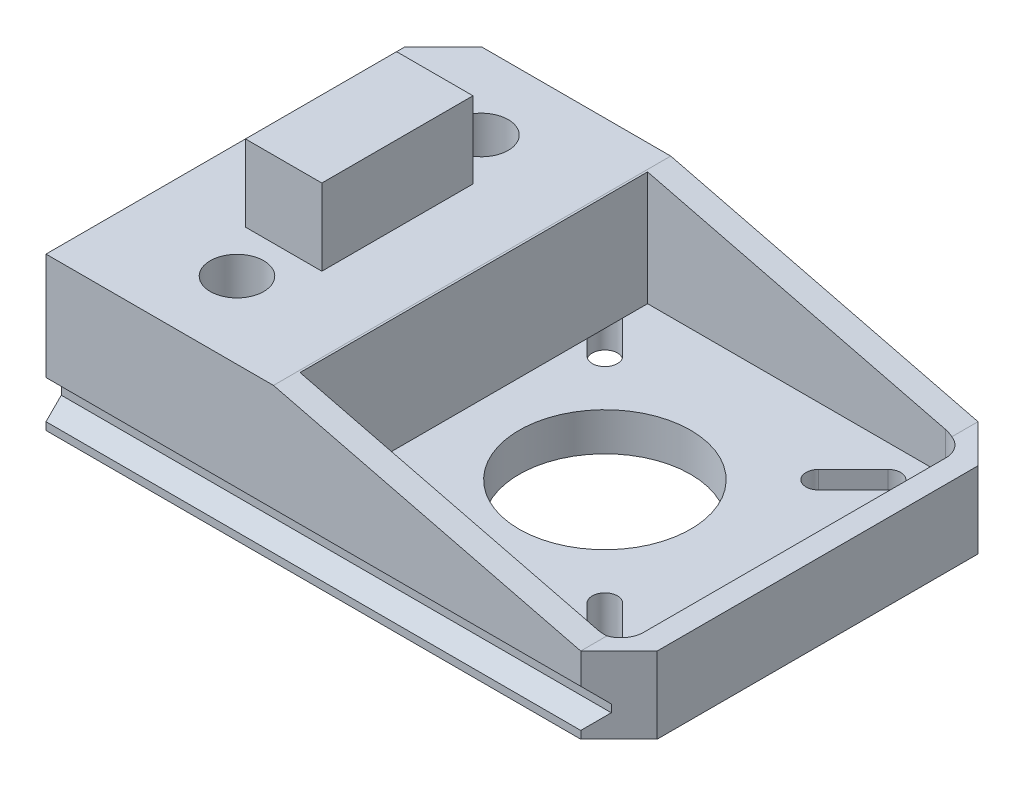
ISO-10303-21;
HEADER;
FILE_DESCRIPTION(('STEP AP214'),'2;1');
FILE_NAME('part.step','',(''),(''),'','','');
FILE_SCHEMA(('AUTOMOTIVE_DESIGN { 1 0 10303 214 1 1 1 1 }'));
ENDSEC;
DATA;
#1=APPLICATION_CONTEXT('core data for automotive mechanical design processes');
#2=APPLICATION_PROTOCOL_DEFINITION('international standard','automotive_design',2000,#1);
#3=PRODUCT_CONTEXT('',#1,'mechanical');
#4=PRODUCT('Part','Part','',(#3));
#5=PRODUCT_RELATED_PRODUCT_CATEGORY('part','',(#4));
#6=PRODUCT_DEFINITION_FORMATION('','',#4);
#7=PRODUCT_DEFINITION_CONTEXT('part definition',#1,'design');
#8=PRODUCT_DEFINITION('design','',#6,#7);
#9=PRODUCT_DEFINITION_SHAPE('','',#8);
#10=(LENGTH_UNIT() NAMED_UNIT(*) SI_UNIT(.MILLI.,.METRE.));
#11=(NAMED_UNIT(*) PLANE_ANGLE_UNIT() SI_UNIT($,.RADIAN.));
#12=(NAMED_UNIT(*) SI_UNIT($,.STERADIAN.) SOLID_ANGLE_UNIT());
#13=UNCERTAINTY_MEASURE_WITH_UNIT(LENGTH_MEASURE(1.E-05),#10,'distance_accuracy_value','');
#14=(GEOMETRIC_REPRESENTATION_CONTEXT(3) GLOBAL_UNCERTAINTY_ASSIGNED_CONTEXT((#13)) GLOBAL_UNIT_ASSIGNED_CONTEXT((#10,
#11,#12)) REPRESENTATION_CONTEXT('',''));
#15=CARTESIAN_POINT('',(0.,0.,0.));
#16=DIRECTION('',(0.,0.,1.));
#17=DIRECTION('',(1.,0.,0.));
#18=AXIS2_PLACEMENT_3D('',#15,#16,#17);
#19=CARTESIAN_POINT('',(0.,30.,0.));
#20=DIRECTION('',(0.,1.,0.));
#21=DIRECTION('',(0.,0.,1.));
#22=AXIS2_PLACEMENT_3D('',#19,#20,#21);
#23=PLANE('',#22);
#24=DIRECTION('',(0.,0.,-1.));
#25=VECTOR('',#24,1.);
#26=CARTESIAN_POINT('',(482.609898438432,30.,62.1317520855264));
#27=LINE('',#26,#25);
#28=CARTESIAN_POINT('',(482.609898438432,30.,62.1317520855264));
#29=VERTEX_POINT('',#28);
#30=CARTESIAN_POINT('',(482.609898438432,30.,81.9134651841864));
#31=VERTEX_POINT('',#30);
#32=EDGE_CURVE('E262',#29,#31,#27,.F.);
#33=ORIENTED_EDGE('',*,*,#32,.T.);
#34=DIRECTION('',(-1.,0.,0.));
#35=VECTOR('',#34,1.);
#36=CARTESIAN_POINT('',(482.609898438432,30.,81.9134651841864));
#37=LINE('',#36,#35);
#38=CARTESIAN_POINT('',(492.609898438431,30.,81.9134651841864));
#39=VERTEX_POINT('',#38);
#40=EDGE_CURVE('E271',#31,#39,#37,.F.);
#41=ORIENTED_EDGE('',*,*,#40,.T.);
#42=DIRECTION('',(0.,0.,1.));
#43=VECTOR('',#42,1.);
#44=CARTESIAN_POINT('',(492.609898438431,30.,62.1317520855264));
#45=LINE('',#44,#43);
#46=CARTESIAN_POINT('',(492.609898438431,30.,62.1317520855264));
#47=VERTEX_POINT('',#46);
#48=EDGE_CURVE('E277',#39,#47,#45,.F.);
#49=ORIENTED_EDGE('',*,*,#48,.T.);
#50=DIRECTION('',(1.,0.,0.));
#51=VECTOR('',#50,1.);
#52=CARTESIAN_POINT('',(482.609898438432,30.,62.1317520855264));
#53=LINE('',#52,#51);
#54=EDGE_CURVE('E280',#47,#29,#53,.F.);
#55=ORIENTED_EDGE('',*,*,#54,.T.);
#56=EDGE_LOOP('',(#33,#41,#49,#55));
#57=FACE_BOUND('',#56,.T.);
#58=ADVANCED_FACE('F17',(#57),#23,.T.);
#59=CARTESIAN_POINT('',(547.609898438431,3.,96.0226086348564));
#60=DIRECTION('',(0.,0.,-1.));
#61=DIRECTION('',(-1.,0.,0.));
#62=AXIS2_PLACEMENT_3D('',#59,#60,#61);
#63=PLANE('',#62);
#64=DIRECTION('',(1.,0.,0.));
#65=VECTOR('',#64,1.);
#66=CARTESIAN_POINT('',(547.609898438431,4.,96.0226086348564));
#67=LINE('',#66,#65);
#68=CARTESIAN_POINT('',(544.609898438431,4.,96.0226086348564));
#69=VERTEX_POINT('',#68);
#70=CARTESIAN_POINT('',(472.609898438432,3.99999999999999,96.0226086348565));
#71=VERTEX_POINT('',#70);
#72=EDGE_CURVE('E244',#69,#71,#67,.F.);
#73=ORIENTED_EDGE('',*,*,#72,.T.);
#74=DIRECTION('',(0.,1.,0.));
#75=VECTOR('',#74,1.);
#76=CARTESIAN_POINT('',(472.609898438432,3.,96.0226086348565));
#77=LINE('',#76,#75);
#78=CARTESIAN_POINT('',(472.609898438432,3.,96.0226086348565));
#79=VERTEX_POINT('',#78);
#80=EDGE_CURVE('E333',#79,#71,#77,.T.);
#81=ORIENTED_EDGE('',*,*,#80,.F.);
#82=DIRECTION('',(1.,0.,0.));
#83=VECTOR('',#82,1.);
#84=CARTESIAN_POINT('',(547.609898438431,2.99999999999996,96.0226086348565));
#85=LINE('',#84,#83);
#86=CARTESIAN_POINT('',(544.609898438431,2.99999999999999,96.0226086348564));
#87=VERTEX_POINT('',#86);
#88=EDGE_CURVE('E238',#79,#87,#85,.T.);
#89=ORIENTED_EDGE('',*,*,#88,.T.);
#90=DIRECTION('',(0.,1.,0.));
#91=VECTOR('',#90,1.);
#92=CARTESIAN_POINT('',(544.609898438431,3.,96.0226086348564));
#93=LINE('',#92,#91);
#94=EDGE_CURVE('E283',#69,#87,#93,.F.);
#95=ORIENTED_EDGE('',*,*,#94,.F.);
#96=EDGE_LOOP('',(#73,#81,#89,#95));
#97=FACE_BOUND('',#96,.T.);
#98=ADVANCED_FACE('F1197',(#97),#63,.F.);
#99=CARTESIAN_POINT('',(482.609898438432,30.,62.1317520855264));
#100=DIRECTION('',(0.,0.,1.));
#101=DIRECTION('',(1.,0.,0.));
#102=AXIS2_PLACEMENT_3D('',#99,#100,#101);
#103=PLANE('',#102);
#104=DIRECTION('',(0.,1.,0.));
#105=VECTOR('',#104,1.);
#106=CARTESIAN_POINT('',(482.609898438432,30.,62.1317520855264));
#107=LINE('',#106,#105);
#108=CARTESIAN_POINT('',(482.609898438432,20.,62.1317520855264));
#109=VERTEX_POINT('',#108);
#110=EDGE_CURVE('E265',#109,#29,#107,.T.);
#111=ORIENTED_EDGE('',*,*,#110,.T.);
#112=ORIENTED_EDGE('',*,*,#54,.F.);
#113=DIRECTION('',(0.,1.,0.));
#114=VECTOR('',#113,1.);
#115=CARTESIAN_POINT('',(492.609898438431,30.,62.1317520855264));
#116=LINE('',#115,#114);
#117=CARTESIAN_POINT('',(492.609898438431,20.,62.1317520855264));
#118=VERTEX_POINT('',#117);
#119=EDGE_CURVE('E274',#47,#118,#116,.F.);
#120=ORIENTED_EDGE('',*,*,#119,.T.);
#121=DIRECTION('',(1.,0.,0.));
#122=VECTOR('',#121,1.);
#123=CARTESIAN_POINT('',(0.,20.,62.1317520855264));
#124=LINE('',#123,#122);
#125=EDGE_CURVE('E326',#109,#118,#124,.T.);
#126=ORIENTED_EDGE('',*,*,#125,.F.);
#127=EDGE_LOOP('',(#111,#112,#120,#126));
#128=FACE_BOUND('',#127,.T.);
#129=ADVANCED_FACE('F693',(#128),#103,.F.);
#130=CARTESIAN_POINT('',(492.609898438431,30.,62.1317520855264));
#131=DIRECTION('',(-1.,0.,0.));
#132=DIRECTION('',(0.,0.,1.));
#133=AXIS2_PLACEMENT_3D('',#130,#131,#132);
#134=PLANE('',#133);
#135=ORIENTED_EDGE('',*,*,#119,.F.);
#136=ORIENTED_EDGE('',*,*,#48,.F.);
#137=DIRECTION('',(0.,1.,0.));
#138=VECTOR('',#137,1.);
#139=CARTESIAN_POINT('',(492.609898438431,30.,81.9134651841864));
#140=LINE('',#139,#138);
#141=CARTESIAN_POINT('',(492.609898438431,20.,81.9134651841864));
#142=VERTEX_POINT('',#141);
#143=EDGE_CURVE('E268',#39,#142,#140,.F.);
#144=ORIENTED_EDGE('',*,*,#143,.T.);
#145=DIRECTION('',(0.,0.,1.));
#146=VECTOR('',#145,1.);
#147=CARTESIAN_POINT('',(492.609898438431,20.,0.));
#148=LINE('',#147,#146);
#149=EDGE_CURVE('E441',#118,#142,#148,.T.);
#150=ORIENTED_EDGE('',*,*,#149,.F.);
#151=EDGE_LOOP('',(#135,#136,#144,#150));
#152=FACE_BOUND('',#151,.T.);
#153=ADVANCED_FACE('F696',(#152),#134,.F.);
#154=CARTESIAN_POINT('',(482.609898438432,30.,81.9134651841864));
#155=DIRECTION('',(0.,0.,-1.));
#156=DIRECTION('',(-1.,0.,0.));
#157=AXIS2_PLACEMENT_3D('',#154,#155,#156);
#158=PLANE('',#157);
#159=ORIENTED_EDGE('',*,*,#143,.F.);
#160=ORIENTED_EDGE('',*,*,#40,.F.);
#161=DIRECTION('',(0.,1.,0.));
#162=VECTOR('',#161,1.);
#163=CARTESIAN_POINT('',(482.609898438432,30.,81.9134651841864));
#164=LINE('',#163,#162);
#165=CARTESIAN_POINT('',(482.609898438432,20.,81.9134651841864));
#166=VERTEX_POINT('',#165);
#167=EDGE_CURVE('E259',#31,#166,#164,.F.);
#168=ORIENTED_EDGE('',*,*,#167,.T.);
#169=DIRECTION('',(1.,0.,0.));
#170=VECTOR('',#169,1.);
#171=CARTESIAN_POINT('',(0.,20.,81.9134651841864));
#172=LINE('',#171,#170);
#173=EDGE_CURVE('E444',#142,#166,#172,.F.);
#174=ORIENTED_EDGE('',*,*,#173,.F.);
#175=EDGE_LOOP('',(#159,#160,#168,#174));
#176=FACE_BOUND('',#175,.T.);
#177=ADVANCED_FACE('F709',(#176),#158,.F.);
#178=CARTESIAN_POINT('',(482.609898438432,30.,62.1317520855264));
#179=DIRECTION('',(1.,0.,0.));
#180=DIRECTION('',(0.,0.,-1.));
#181=AXIS2_PLACEMENT_3D('',#178,#179,#180);
#182=PLANE('',#181);
#183=ORIENTED_EDGE('',*,*,#167,.F.);
#184=ORIENTED_EDGE('',*,*,#32,.F.);
#185=ORIENTED_EDGE('',*,*,#110,.F.);
#186=DIRECTION('',(0.,0.,1.));
#187=VECTOR('',#186,1.);
#188=CARTESIAN_POINT('',(482.609898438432,20.,0.));
#189=LINE('',#188,#187);
#190=EDGE_CURVE('E447',#166,#109,#189,.F.);
#191=ORIENTED_EDGE('',*,*,#190,.F.);
#192=EDGE_LOOP('',(#183,#184,#185,#191));
#193=FACE_BOUND('',#192,.T.);
#194=ADVANCED_FACE('F706',(#193),#182,.F.);
#195=CARTESIAN_POINT('',(541.609898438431,88.7677249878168,52.2761188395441));
#196=DIRECTION('',(0.,-1.,0.));
#197=DIRECTION('',(0.,0.,-1.));
#198=AXIS2_PLACEMENT_3D('',#195,#196,#197);
#199=CYLINDRICAL_SURFACE('',#198,3.);
#200=CARTESIAN_POINT('',(541.609898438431,9.99999999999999,52.2761188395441));
#201=DIRECTION('',(0.,-1.,0.));
#202=DIRECTION('',(0.,0.,-1.));
#203=AXIS2_PLACEMENT_3D('',#200,#201,#202);
#204=CIRCLE('',#203,3.);
#205=CARTESIAN_POINT('',(544.609898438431,10.,52.2761188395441));
#206=VERTEX_POINT('',#205);
#207=CARTESIAN_POINT('',(542.609898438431,10.,49.4476917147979));
#208=VERTEX_POINT('',#207);
#209=EDGE_CURVE('E167',#206,#208,#204,.F.);
#210=ORIENTED_EDGE('',*,*,#209,.T.);
#211=CARTESIAN_POINT('',(541.609898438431,10.2486083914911,52.2761188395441));
#212=DIRECTION('',(-0.241264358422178,-0.97045943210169,0.));
#213=DIRECTION('',(0.97045943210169,-0.241264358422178,0.));
#214=AXIS2_PLACEMENT_3D('',#211,#212,#213);
#215=ELLIPSE('',#214,3.09131932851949,3.);
#216=CARTESIAN_POINT('',(541.609898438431,10.2486083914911,49.2761188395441));
#217=VERTEX_POINT('',#216);
#218=EDGE_CURVE('E20',#208,#217,#215,.F.);
#219=ORIENTED_EDGE('',*,*,#218,.T.);
#220=DIRECTION('',(0.,1.,0.));
#221=VECTOR('',#220,1.);
#222=CARTESIAN_POINT('',(541.609898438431,88.7677249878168,49.2761188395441));
#223=LINE('',#222,#221);
#224=CARTESIAN_POINT('',(541.609898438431,5.,49.2761188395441));
#225=VERTEX_POINT('',#224);
#226=EDGE_CURVE('E247',#217,#225,#223,.F.);
#227=ORIENTED_EDGE('',*,*,#226,.T.);
#228=CARTESIAN_POINT('',(541.609898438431,5.,52.2761188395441));
#229=DIRECTION('',(0.,-1.,0.));
#230=DIRECTION('',(0.,0.,-1.));
#231=AXIS2_PLACEMENT_3D('',#228,#229,#230);
#232=CIRCLE('',#231,3.);
#233=CARTESIAN_POINT('',(544.609898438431,5.,52.2761188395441));
#234=VERTEX_POINT('',#233);
#235=EDGE_CURVE('E420',#225,#234,#232,.T.);
#236=ORIENTED_EDGE('',*,*,#235,.T.);
#237=DIRECTION('',(0.,1.,0.));
#238=VECTOR('',#237,1.);
#239=CARTESIAN_POINT('',(544.609898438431,88.7677249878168,52.2761188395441));
#240=LINE('',#239,#238);
#241=EDGE_CURVE('E257',#234,#206,#240,.T.);
#242=ORIENTED_EDGE('',*,*,#241,.T.);
#243=EDGE_LOOP('',(#210,#219,#227,#236,#242));
#244=FACE_BOUND('',#243,.T.);
#245=ADVANCED_FACE('F809',(#244),#199,.F.);
#246=CARTESIAN_POINT('',(544.609898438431,88.7677249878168,52.2761188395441));
#247=DIRECTION('',(1.,0.,0.));
#248=DIRECTION('',(0.,0.,-1.));
#249=AXIS2_PLACEMENT_3D('',#246,#247,#248);
#250=PLANE('',#249);
#251=DIRECTION('',(0.,0.,-1.));
#252=VECTOR('',#251,1.);
#253=CARTESIAN_POINT('',(544.609898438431,10.,98.0226086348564));
#254=LINE('',#253,#252);
#255=CARTESIAN_POINT('',(544.609898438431,10.,91.7690984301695));
#256=VERTEX_POINT('',#255);
#257=EDGE_CURVE('E424',#256,#206,#254,.T.);
#258=ORIENTED_EDGE('',*,*,#257,.T.);
#259=ORIENTED_EDGE('',*,*,#241,.F.);
#260=DIRECTION('',(0.,0.,-1.));
#261=VECTOR('',#260,1.);
#262=CARTESIAN_POINT('',(544.609898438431,5.,0.));
#263=LINE('',#262,#261);
#264=CARTESIAN_POINT('',(544.609898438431,5.,91.7690984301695));
#265=VERTEX_POINT('',#264);
#266=EDGE_CURVE('E419',#234,#265,#263,.F.);
#267=ORIENTED_EDGE('',*,*,#266,.T.);
#268=DIRECTION('',(0.,-1.,0.));
#269=VECTOR('',#268,1.);
#270=CARTESIAN_POINT('',(544.609898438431,88.7677249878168,91.7690984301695));
#271=LINE('',#270,#269);
#272=EDGE_CURVE('E255',#265,#256,#271,.F.);
#273=ORIENTED_EDGE('',*,*,#272,.T.);
#274=EDGE_LOOP('',(#258,#259,#267,#273));
#275=FACE_BOUND('',#274,.T.);
#276=ADVANCED_FACE('F805',(#275),#250,.F.);
#277=CARTESIAN_POINT('',(541.609898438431,88.7677249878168,91.7690984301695));
#278=DIRECTION('',(0.,-1.,0.));
#279=DIRECTION('',(0.,0.,-1.));
#280=AXIS2_PLACEMENT_3D('',#277,#278,#279);
#281=CYLINDRICAL_SURFACE('',#280,3.);
#282=CARTESIAN_POINT('',(541.609898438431,9.99999999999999,91.7690984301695));
#283=DIRECTION('',(0.,-1.,0.));
#284=DIRECTION('',(0.,0.,-1.));
#285=AXIS2_PLACEMENT_3D('',#282,#283,#284);
#286=CIRCLE('',#285,3.);
#287=CARTESIAN_POINT('',(542.609898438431,10.,94.5975255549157));
#288=VERTEX_POINT('',#287);
#289=EDGE_CURVE('E425',#288,#256,#286,.F.);
#290=ORIENTED_EDGE('',*,*,#289,.T.);
#291=ORIENTED_EDGE('',*,*,#272,.F.);
#292=CARTESIAN_POINT('',(541.609898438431,5.,91.7690984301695));
#293=DIRECTION('',(0.,-1.,0.));
#294=DIRECTION('',(0.,0.,-1.));
#295=AXIS2_PLACEMENT_3D('',#292,#293,#294);
#296=CIRCLE('',#295,3.);
#297=CARTESIAN_POINT('',(541.609898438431,5.,94.7690984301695));
#298=VERTEX_POINT('',#297);
#299=EDGE_CURVE('E417',#265,#298,#296,.T.);
#300=ORIENTED_EDGE('',*,*,#299,.T.);
#301=DIRECTION('',(0.,1.,0.));
#302=VECTOR('',#301,1.);
#303=CARTESIAN_POINT('',(541.609898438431,88.7677249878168,94.7690984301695));
#304=LINE('',#303,#302);
#305=CARTESIAN_POINT('',(541.609898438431,10.2486083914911,94.7690984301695));
#306=VERTEX_POINT('',#305);
#307=EDGE_CURVE('E213',#298,#306,#304,.T.);
#308=ORIENTED_EDGE('',*,*,#307,.T.);
#309=CARTESIAN_POINT('',(541.609898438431,10.2486083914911,91.7690984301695));
#310=DIRECTION('',(-0.241264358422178,-0.97045943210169,0.));
#311=DIRECTION('',(0.97045943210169,-0.241264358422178,0.));
#312=AXIS2_PLACEMENT_3D('',#309,#310,#311);
#313=ELLIPSE('',#312,3.09131932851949,3.);
#314=EDGE_CURVE('E227',#306,#288,#313,.F.);
#315=ORIENTED_EDGE('',*,*,#314,.T.);
#316=EDGE_LOOP('',(#290,#291,#300,#308,#315));
#317=FACE_BOUND('',#316,.T.);
#318=ADVANCED_FACE('F808',(#317),#281,.F.);
#319=CARTESIAN_POINT('',(541.609898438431,88.7677249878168,94.7690984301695));
#320=DIRECTION('',(0.,0.,1.));
#321=DIRECTION('',(1.,0.,0.));
#322=AXIS2_PLACEMENT_3D('',#319,#320,#321);
#323=PLANE('',#322);
#324=DIRECTION('',(0.97045943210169,-0.241264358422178,0.));
#325=VECTOR('',#324,1.);
#326=CARTESIAN_POINT('',(542.609898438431,10.,94.7690984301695));
#327=LINE('',#326,#325);
#328=CARTESIAN_POINT('',(502.609898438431,19.9443356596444,94.7690984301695));
#329=VERTEX_POINT('',#328);
#330=EDGE_CURVE('E205',#329,#306,#327,.T.);
#331=ORIENTED_EDGE('',*,*,#330,.T.);
#332=ORIENTED_EDGE('',*,*,#307,.F.);
#333=DIRECTION('',(1.,0.,0.));
#334=VECTOR('',#333,1.);
#335=CARTESIAN_POINT('',(0.,5.,94.7690984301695));
#336=LINE('',#335,#334);
#337=CARTESIAN_POINT('',(502.609898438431,5.,94.7690984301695));
#338=VERTEX_POINT('',#337);
#339=EDGE_CURVE('E208',#298,#338,#336,.F.);
#340=ORIENTED_EDGE('',*,*,#339,.T.);
#341=DIRECTION('',(0.,1.,0.));
#342=VECTOR('',#341,1.);
#343=CARTESIAN_POINT('',(502.609898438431,20.,94.7690984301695));
#344=LINE('',#343,#342);
#345=EDGE_CURVE('E200',#338,#329,#344,.T.);
#346=ORIENTED_EDGE('',*,*,#345,.T.);
#347=EDGE_LOOP('',(#331,#332,#340,#346));
#348=FACE_BOUND('',#347,.T.);
#349=ADVANCED_FACE('F202',(#348),#323,.F.);
#350=CARTESIAN_POINT('',(502.609898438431,20.,46.0226086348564));
#351=DIRECTION('',(-1.,0.,0.));
#352=DIRECTION('',(0.,0.,1.));
#353=AXIS2_PLACEMENT_3D('',#350,#351,#352);
#354=PLANE('',#353);
#355=DIRECTION('',(0.,0.,1.));
#356=VECTOR('',#355,1.);
#357=CARTESIAN_POINT('',(502.609898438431,19.9443356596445,98.0226086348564));
#358=LINE('',#357,#356);
#359=CARTESIAN_POINT('',(502.609898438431,19.9443356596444,49.2761188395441));
#360=VERTEX_POINT('',#359);
#361=EDGE_CURVE('E216',#360,#329,#358,.T.);
#362=ORIENTED_EDGE('',*,*,#361,.T.);
#363=ORIENTED_EDGE('',*,*,#345,.F.);
#364=DIRECTION('',(0.,0.,-1.));
#365=VECTOR('',#364,1.);
#366=CARTESIAN_POINT('',(502.609898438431,5.,0.));
#367=LINE('',#366,#365);
#368=CARTESIAN_POINT('',(502.609898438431,5.,91.5155882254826));
#369=VERTEX_POINT('',#368);
#370=EDGE_CURVE('E496',#338,#369,#367,.T.);
#371=ORIENTED_EDGE('',*,*,#370,.T.);
#372=DIRECTION('',(0.,0.,1.));
#373=VECTOR('',#372,1.);
#374=CARTESIAN_POINT('',(502.609898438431,5.,0.));
#375=LINE('',#374,#373);
#376=CARTESIAN_POINT('',(502.609898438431,5.,86.8486834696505));
#377=VERTEX_POINT('',#376);
#378=EDGE_CURVE('E422',#369,#377,#375,.F.);
#379=ORIENTED_EDGE('',*,*,#378,.T.);
#380=DIRECTION('',(0.,0.,-1.));
#381=VECTOR('',#380,1.);
#382=CARTESIAN_POINT('',(502.609898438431,5.,0.));
#383=LINE('',#382,#381);
#384=CARTESIAN_POINT('',(502.609898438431,5.,57.1965338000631));
#385=VERTEX_POINT('',#384);
#386=EDGE_CURVE('E455',#377,#385,#383,.T.);
#387=ORIENTED_EDGE('',*,*,#386,.T.);
#388=DIRECTION('',(0.,0.,1.));
#389=VECTOR('',#388,1.);
#390=CARTESIAN_POINT('',(502.609898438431,5.,0.));
#391=LINE('',#390,#389);
#392=CARTESIAN_POINT('',(502.609898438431,5.,52.5296290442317));
#393=VERTEX_POINT('',#392);
#394=EDGE_CURVE('E450',#385,#393,#391,.F.);
#395=ORIENTED_EDGE('',*,*,#394,.T.);
#396=DIRECTION('',(0.,0.,-1.));
#397=VECTOR('',#396,1.);
#398=CARTESIAN_POINT('',(502.609898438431,5.,0.));
#399=LINE('',#398,#397);
#400=CARTESIAN_POINT('',(502.609898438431,5.,49.2761188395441));
#401=VERTEX_POINT('',#400);
#402=EDGE_CURVE('E453',#393,#401,#399,.T.);
#403=ORIENTED_EDGE('',*,*,#402,.T.);
#404=DIRECTION('',(0.,1.,0.));
#405=VECTOR('',#404,1.);
#406=CARTESIAN_POINT('',(502.609898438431,88.7677249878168,49.2761188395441));
#407=LINE('',#406,#405);
#408=EDGE_CURVE('E212',#401,#360,#407,.T.);
#409=ORIENTED_EDGE('',*,*,#408,.T.);
#410=EDGE_LOOP('',(#362,#363,#371,#379,#387,#395,#403,#409));
#411=FACE_BOUND('',#410,.T.);
#412=ADVANCED_FACE('F217',(#411),#354,.F.);
#413=CARTESIAN_POINT('',(502.609898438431,88.7677249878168,49.2761188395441));
#414=DIRECTION('',(0.,0.,-1.));
#415=DIRECTION('',(-1.,0.,0.));
#416=AXIS2_PLACEMENT_3D('',#413,#414,#415);
#417=PLANE('',#416);
#418=DIRECTION('',(0.97045943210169,-0.241264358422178,0.));
#419=VECTOR('',#418,1.);
#420=CARTESIAN_POINT('',(542.609898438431,10.,49.2761188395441));
#421=LINE('',#420,#419);
#422=EDGE_CURVE('E222',#217,#360,#421,.F.);
#423=ORIENTED_EDGE('',*,*,#422,.T.);
#424=ORIENTED_EDGE('',*,*,#408,.F.);
#425=DIRECTION('',(1.,0.,0.));
#426=VECTOR('',#425,1.);
#427=CARTESIAN_POINT('',(0.,5.,49.2761188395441));
#428=LINE('',#427,#426);
#429=EDGE_CURVE('E416',#401,#225,#428,.T.);
#430=ORIENTED_EDGE('',*,*,#429,.T.);
#431=ORIENTED_EDGE('',*,*,#226,.F.);
#432=EDGE_LOOP('',(#423,#424,#430,#431));
#433=FACE_BOUND('',#432,.T.);
#434=ADVANCED_FACE('F674',(#433),#417,.F.);
#435=CARTESIAN_POINT('',(547.609898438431,5.,98.0226086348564));
#436=DIRECTION('',(0.,0.,-1.));
#437=DIRECTION('',(-1.,0.,0.));
#438=AXIS2_PLACEMENT_3D('',#435,#436,#437);
#439=PLANE('',#438);
#440=DIRECTION('',(1.,0.,0.));
#441=VECTOR('',#440,1.);
#442=CARTESIAN_POINT('',(547.609898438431,6.00000000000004,98.0226086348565));
#443=LINE('',#442,#441);
#444=CARTESIAN_POINT('',(472.609898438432,5.99999999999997,98.0226086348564));
#445=VERTEX_POINT('',#444);
#446=CARTESIAN_POINT('',(542.609898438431,6.00000000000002,98.0226086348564));
#447=VERTEX_POINT('',#446);
#448=EDGE_CURVE('E241',#445,#447,#443,.T.);
#449=ORIENTED_EDGE('',*,*,#448,.T.);
#450=DIRECTION('',(0.,1.,0.));
#451=VECTOR('',#450,1.);
#452=CARTESIAN_POINT('',(542.609898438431,5.,98.0226086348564));
#453=LINE('',#452,#451);
#454=CARTESIAN_POINT('',(542.609898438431,10.,98.0226086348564));
#455=VERTEX_POINT('',#454);
#456=EDGE_CURVE('E306',#447,#455,#453,.T.);
#457=ORIENTED_EDGE('',*,*,#456,.T.);
#458=DIRECTION('',(0.97045943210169,-0.241264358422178,0.));
#459=VECTOR('',#458,1.);
#460=CARTESIAN_POINT('',(542.609898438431,10.,98.0226086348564));
#461=LINE('',#460,#459);
#462=CARTESIAN_POINT('',(502.385994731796,20.,98.0226086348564));
#463=VERTEX_POINT('',#462);
#464=EDGE_CURVE('E176',#455,#463,#461,.F.);
#465=ORIENTED_EDGE('',*,*,#464,.T.);
#466=DIRECTION('',(1.,0.,0.));
#467=VECTOR('',#466,1.);
#468=CARTESIAN_POINT('',(0.,20.,98.0226086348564));
#469=LINE('',#468,#467);
#470=CARTESIAN_POINT('',(472.609898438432,20.,98.0226086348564));
#471=VERTEX_POINT('',#470);
#472=EDGE_CURVE('E320',#471,#463,#469,.T.);
#473=ORIENTED_EDGE('',*,*,#472,.F.);
#474=DIRECTION('',(0.,1.,0.));
#475=VECTOR('',#474,1.);
#476=CARTESIAN_POINT('',(472.609898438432,5.,98.0226086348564));
#477=LINE('',#476,#475);
#478=EDGE_CURVE('E548',#471,#445,#477,.F.);
#479=ORIENTED_EDGE('',*,*,#478,.T.);
#480=EDGE_LOOP('',(#449,#457,#465,#473,#479));
#481=FACE_BOUND('',#480,.T.);
#482=ADVANCED_FACE('F797',(#481),#439,.F.);
#483=CARTESIAN_POINT('',(547.609898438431,4.,96.0226086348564));
#484=DIRECTION('',(0.,0.707106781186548,-0.707106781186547));
#485=DIRECTION('',(0.,0.707106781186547,0.707106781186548));
#486=AXIS2_PLACEMENT_3D('',#483,#484,#485);
#487=PLANE('',#486);
#488=ORIENTED_EDGE('',*,*,#448,.F.);
#489=DIRECTION('',(0.,-0.707106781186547,-0.707106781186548));
#490=VECTOR('',#489,1.);
#491=CARTESIAN_POINT('',(472.609898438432,6.,98.0226086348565));
#492=LINE('',#491,#490);
#493=EDGE_CURVE('E551',#445,#71,#492,.T.);
#494=ORIENTED_EDGE('',*,*,#493,.T.);
#495=ORIENTED_EDGE('',*,*,#72,.F.);
#496=DIRECTION('',(-0.577350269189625,0.577350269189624,0.577350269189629));
#497=VECTOR('',#496,1.);
#498=CARTESIAN_POINT('',(544.609898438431,4.,96.0226086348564));
#499=LINE('',#498,#497);
#500=EDGE_CURVE('E309',#69,#447,#499,.T.);
#501=ORIENTED_EDGE('',*,*,#500,.T.);
#502=EDGE_LOOP('',(#488,#494,#495,#501));
#503=FACE_BOUND('',#502,.T.);
#504=ADVANCED_FACE('F799',(#503),#487,.F.);
#505=CARTESIAN_POINT('',(547.609898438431,1.,98.0226086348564));
#506=DIRECTION('',(0.,-0.707106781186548,-0.707106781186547));
#507=DIRECTION('',(0.,0.707106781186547,-0.707106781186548));
#508=AXIS2_PLACEMENT_3D('',#505,#506,#507);
#509=PLANE('',#508);
#510=ORIENTED_EDGE('',*,*,#88,.F.);
#511=DIRECTION('',(0.,-0.707106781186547,0.707106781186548));
#512=VECTOR('',#511,1.);
#513=CARTESIAN_POINT('',(472.609898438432,3.,96.0226086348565));
#514=LINE('',#513,#512);
#515=CARTESIAN_POINT('',(472.609898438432,1.00000000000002,98.0226086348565));
#516=VERTEX_POINT('',#515);
#517=EDGE_CURVE('E554',#79,#516,#514,.T.);
#518=ORIENTED_EDGE('',*,*,#517,.T.);
#519=DIRECTION('',(-1.,0.,0.));
#520=VECTOR('',#519,1.);
#521=CARTESIAN_POINT('',(547.609898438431,1.,98.0226086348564));
#522=LINE('',#521,#520);
#523=CARTESIAN_POINT('',(542.609898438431,1.,98.0226086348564));
#524=VERTEX_POINT('',#523);
#525=EDGE_CURVE('E539',#516,#524,#522,.F.);
#526=ORIENTED_EDGE('',*,*,#525,.T.);
#527=DIRECTION('',(0.577350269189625,0.577350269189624,-0.577350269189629));
#528=VECTOR('',#527,1.);
#529=CARTESIAN_POINT('',(542.609898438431,1.,98.0226086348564));
#530=LINE('',#529,#528);
#531=EDGE_CURVE('E536',#524,#87,#530,.T.);
#532=ORIENTED_EDGE('',*,*,#531,.T.);
#533=EDGE_LOOP('',(#510,#518,#526,#532));
#534=FACE_BOUND('',#533,.T.);
#535=ADVANCED_FACE('F918',(#534),#509,.F.);
#536=CARTESIAN_POINT('',(542.609898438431,10.,98.0226086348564));
#537=DIRECTION('',(-0.241264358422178,-0.97045943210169,0.));
#538=DIRECTION('',(0.97045943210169,-0.241264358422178,0.));
#539=AXIS2_PLACEMENT_3D('',#536,#537,#538);
#540=PLANE('',#539);
#541=DIRECTION('',(-0.97045943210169,0.241264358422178,0.));
#542=VECTOR('',#541,1.);
#543=CARTESIAN_POINT('',(542.609898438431,10.,46.0226086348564));
#544=LINE('',#543,#542);
#545=CARTESIAN_POINT('',(542.609898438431,10.,46.0226086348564));
#546=VERTEX_POINT('',#545);
#547=CARTESIAN_POINT('',(502.385994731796,20.,46.0226086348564));
#548=VERTEX_POINT('',#547);
#549=EDGE_CURVE('E284',#546,#548,#544,.T.);
#550=ORIENTED_EDGE('',*,*,#549,.T.);
#551=DIRECTION('',(0.,0.,1.));
#552=VECTOR('',#551,1.);
#553=CARTESIAN_POINT('',(502.385994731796,20.,0.));
#554=LINE('',#553,#552);
#555=EDGE_CURVE('E317',#463,#548,#554,.F.);
#556=ORIENTED_EDGE('',*,*,#555,.F.);
#557=ORIENTED_EDGE('',*,*,#464,.F.);
#558=DIRECTION('',(0.,0.,-1.));
#559=VECTOR('',#558,1.);
#560=CARTESIAN_POINT('',(542.609898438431,10.,98.0226086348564));
#561=LINE('',#560,#559);
#562=EDGE_CURVE('E303',#455,#288,#561,.T.);
#563=ORIENTED_EDGE('',*,*,#562,.T.);
#564=ORIENTED_EDGE('',*,*,#314,.F.);
#565=ORIENTED_EDGE('',*,*,#330,.F.);
#566=ORIENTED_EDGE('',*,*,#361,.F.);
#567=ORIENTED_EDGE('',*,*,#422,.F.);
#568=ORIENTED_EDGE('',*,*,#218,.F.);
#569=DIRECTION('',(0.,0.,-1.));
#570=VECTOR('',#569,1.);
#571=CARTESIAN_POINT('',(542.609898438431,10.,98.0226086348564));
#572=LINE('',#571,#570);
#573=EDGE_CURVE('E321',#208,#546,#572,.T.);
#574=ORIENTED_EDGE('',*,*,#573,.T.);
#575=EDGE_LOOP('',(#550,#556,#557,#563,#564,#565,#566,#567,#568,#574));
#576=FACE_BOUND('',#575,.T.);
#577=ADVANCED_FACE('F225',(#576),#540,.F.);
#578=CARTESIAN_POINT('',(547.609898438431,10.,98.0226086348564));
#579=DIRECTION('',(0.,-1.,0.));
#580=DIRECTION('',(0.,0.,-1.));
#581=AXIS2_PLACEMENT_3D('',#578,#579,#580);
#582=PLANE('',#581);
#583=DIRECTION('',(0.,0.,1.));
#584=VECTOR('',#583,1.);
#585=CARTESIAN_POINT('',(547.609898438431,10.,46.0226086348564));
#586=LINE('',#585,#584);
#587=CARTESIAN_POINT('',(547.609898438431,10.,93.0226086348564));
#588=VERTEX_POINT('',#587);
#589=CARTESIAN_POINT('',(547.609898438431,10.,51.0226086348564));
#590=VERTEX_POINT('',#589);
#591=EDGE_CURVE('E415',#588,#590,#586,.F.);
#592=ORIENTED_EDGE('',*,*,#591,.T.);
#593=DIRECTION('',(0.707106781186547,0.,0.707106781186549));
#594=VECTOR('',#593,1.);
#595=CARTESIAN_POINT('',(542.609898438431,10.,46.0226086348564));
#596=LINE('',#595,#594);
#597=EDGE_CURVE('E290',#590,#546,#596,.F.);
#598=ORIENTED_EDGE('',*,*,#597,.T.);
#599=ORIENTED_EDGE('',*,*,#573,.F.);
#600=ORIENTED_EDGE('',*,*,#209,.F.);
#601=ORIENTED_EDGE('',*,*,#257,.F.);
#602=ORIENTED_EDGE('',*,*,#289,.F.);
#603=ORIENTED_EDGE('',*,*,#562,.F.);
#604=DIRECTION('',(-0.707106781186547,0.,0.707106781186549));
#605=VECTOR('',#604,1.);
#606=CARTESIAN_POINT('',(547.609898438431,10.,93.0226086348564));
#607=LINE('',#606,#605);
#608=EDGE_CURVE('E308',#455,#588,#607,.F.);
#609=ORIENTED_EDGE('',*,*,#608,.T.);
#610=EDGE_LOOP('',(#592,#598,#599,#600,#601,#602,#603,#609));
#611=FACE_BOUND('',#610,.T.);
#612=ADVANCED_FACE('F775',(#611),#582,.F.);
#613=CARTESIAN_POINT('',(0.,20.,0.));
#614=DIRECTION('',(0.,1.,0.));
#615=DIRECTION('',(0.,0.,1.));
#616=AXIS2_PLACEMENT_3D('',#613,#614,#615);
#617=PLANE('',#616);
#618=ORIENTED_EDGE('',*,*,#173,.T.);
#619=ORIENTED_EDGE('',*,*,#190,.T.);
#620=ORIENTED_EDGE('',*,*,#125,.T.);
#621=ORIENTED_EDGE('',*,*,#149,.T.);
#622=EDGE_LOOP('',(#618,#619,#620,#621));
#623=FACE_BOUND('',#622,.T.);
#624=CARTESIAN_POINT('',(487.609898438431,20.,88.0226086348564));
#625=DIRECTION('',(0.,-1.,0.));
#626=DIRECTION('',(0.,0.,-1.));
#627=AXIS2_PLACEMENT_3D('',#624,#625,#626);
#628=CIRCLE('',#627,3.5);
#629=CARTESIAN_POINT('',(487.609898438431,20.,84.5226086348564));
#630=VERTEX_POINT('',#629);
#631=EDGE_CURVE('E412',#630,#630,#628,.T.);
#632=ORIENTED_EDGE('',*,*,#631,.T.);
#633=EDGE_LOOP('',(#632));
#634=FACE_BOUND('',#633,.T.);
#635=CARTESIAN_POINT('',(487.609898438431,20.,56.0226086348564));
#636=DIRECTION('',(0.,-1.,0.));
#637=DIRECTION('',(0.,0.,-1.));
#638=AXIS2_PLACEMENT_3D('',#635,#636,#637);
#639=CIRCLE('',#638,3.5);
#640=CARTESIAN_POINT('',(487.609898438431,20.,52.5226086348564));
#641=VERTEX_POINT('',#640);
#642=EDGE_CURVE('E406',#641,#641,#639,.T.);
#643=ORIENTED_EDGE('',*,*,#642,.T.);
#644=EDGE_LOOP('',(#643));
#645=FACE_BOUND('',#644,.T.);
#646=DIRECTION('',(0.,0.,-1.));
#647=VECTOR('',#646,1.);
#648=CARTESIAN_POINT('',(472.609898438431,20.,46.0226086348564));
#649=LINE('',#648,#647);
#650=CARTESIAN_POINT('',(472.609898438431,20.,51.0226086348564));
#651=VERTEX_POINT('',#650);
#652=EDGE_CURVE('E545',#651,#471,#649,.F.);
#653=ORIENTED_EDGE('',*,*,#652,.T.);
#654=ORIENTED_EDGE('',*,*,#472,.T.);
#655=ORIENTED_EDGE('',*,*,#555,.T.);
#656=DIRECTION('',(1.,0.,0.));
#657=VECTOR('',#656,1.);
#658=CARTESIAN_POINT('',(547.609898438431,20.,46.0226086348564));
#659=LINE('',#658,#657);
#660=CARTESIAN_POINT('',(477.609898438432,20.,46.0226086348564));
#661=VERTEX_POINT('',#660);
#662=EDGE_CURVE('E286',#548,#661,#659,.F.);
#663=ORIENTED_EDGE('',*,*,#662,.T.);
#664=DIRECTION('',(0.707106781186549,0.,-0.707106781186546));
#665=VECTOR('',#664,1.);
#666=CARTESIAN_POINT('',(472.609898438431,20.,51.0226086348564));
#667=LINE('',#666,#665);
#668=EDGE_CURVE('E563',#661,#651,#667,.F.);
#669=ORIENTED_EDGE('',*,*,#668,.T.);
#670=EDGE_LOOP('',(#653,#654,#655,#663,#669));
#671=FACE_BOUND('',#670,.T.);
#672=ADVANCED_FACE('F701',(#623,#634,#645,#671),#617,.T.);
#673=CARTESIAN_POINT('',(0.,5.,0.));
#674=DIRECTION('',(0.,1.,0.));
#675=DIRECTION('',(0.,0.,1.));
#676=AXIS2_PLACEMENT_3D('',#673,#674,#675);
#677=PLANE('',#676);
#678=ORIENTED_EDGE('',*,*,#394,.F.);
#679=DIRECTION('',(-0.707106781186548,0.,-0.707106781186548));
#680=VECTOR('',#679,1.);
#681=CARTESIAN_POINT('',(500.06716555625,5.,54.653800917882));
#682=LINE('',#681,#680);
#683=CARTESIAN_POINT('',(500.06716555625,5.,54.6538009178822));
#684=VERTEX_POINT('',#683);
#685=EDGE_CURVE('E468',#684,#385,#682,.F.);
#686=ORIENTED_EDGE('',*,*,#685,.F.);
#687=CARTESIAN_POINT('',(501.233891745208,5.,53.4870747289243));
#688=DIRECTION('',(0.,-1.,0.));
#689=DIRECTION('',(0.,0.,-1.));
#690=AXIS2_PLACEMENT_3D('',#687,#688,#689);
#691=CIRCLE('',#690,1.65000000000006);
#692=CARTESIAN_POINT('',(502.400617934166,5.,52.3203485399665));
#693=VERTEX_POINT('',#692);
#694=EDGE_CURVE('E402',#684,#693,#691,.T.);
#695=ORIENTED_EDGE('',*,*,#694,.T.);
#696=DIRECTION('',(0.707106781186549,0.,0.707106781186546));
#697=VECTOR('',#696,1.);
#698=CARTESIAN_POINT('',(502.400617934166,5.,52.3203485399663));
#699=LINE('',#698,#697);
#700=EDGE_CURVE('E458',#393,#693,#699,.F.);
#701=ORIENTED_EDGE('',*,*,#700,.F.);
#702=EDGE_LOOP('',(#678,#686,#695,#701));
#703=FACE_BOUND('',#702,.T.);
#704=ADVANCED_FACE('F663',(#703),#677,.F.);
#705=CARTESIAN_POINT('',(0.,5.,0.));
#706=DIRECTION('',(0.,1.,0.));
#707=DIRECTION('',(0.,0.,1.));
#708=AXIS2_PLACEMENT_3D('',#705,#706,#707);
#709=PLANE('',#708);
#710=ORIENTED_EDGE('',*,*,#378,.F.);
#711=DIRECTION('',(0.707106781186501,0.,-0.707106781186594));
#712=VECTOR('',#711,1.);
#713=CARTESIAN_POINT('',(502.400617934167,5.,91.7248687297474));
#714=LINE('',#713,#712);
#715=CARTESIAN_POINT('',(502.400617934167,5.,91.7248687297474));
#716=VERTEX_POINT('',#715);
#717=EDGE_CURVE('E465',#716,#369,#714,.T.);
#718=ORIENTED_EDGE('',*,*,#717,.F.);
#719=CARTESIAN_POINT('',(501.233891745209,5.,90.5581425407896));
#720=DIRECTION('',(0.,-1.,0.));
#721=DIRECTION('',(0.,0.,-1.));
#722=AXIS2_PLACEMENT_3D('',#719,#720,#721);
#723=CIRCLE('',#722,1.6500000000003);
#724=CARTESIAN_POINT('',(500.067165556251,5.,89.3914163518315));
#725=VERTEX_POINT('',#724);
#726=EDGE_CURVE('E377',#716,#725,#723,.T.);
#727=ORIENTED_EDGE('',*,*,#726,.T.);
#728=DIRECTION('',(0.707106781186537,0.,-0.707106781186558));
#729=VECTOR('',#728,1.);
#730=CARTESIAN_POINT('',(500.067165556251,5.,89.3914163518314));
#731=LINE('',#730,#729);
#732=EDGE_CURVE('E380',#377,#725,#731,.F.);
#733=ORIENTED_EDGE('',*,*,#732,.F.);
#734=EDGE_LOOP('',(#710,#718,#727,#733));
#735=FACE_BOUND('',#734,.T.);
#736=ADVANCED_FACE('F646',(#735),#709,.F.);
#737=CARTESIAN_POINT('',(0.,5.,0.));
#738=DIRECTION('',(0.,-1.,0.));
#739=DIRECTION('',(0.,0.,-1.));
#740=AXIS2_PLACEMENT_3D('',#737,#738,#739);
#741=PLANE('',#740);
#742=ORIENTED_EDGE('',*,*,#402,.F.);
#743=DIRECTION('',(0.707106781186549,0.,0.707106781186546));
#744=VECTOR('',#743,1.);
#745=CARTESIAN_POINT('',(502.400617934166,5.,52.3203485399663));
#746=LINE('',#745,#744);
#747=CARTESIAN_POINT('',(506.94477381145,5.,56.8645044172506));
#748=VERTEX_POINT('',#747);
#749=EDGE_CURVE('E409',#748,#393,#746,.F.);
#750=ORIENTED_EDGE('',*,*,#749,.F.);
#751=CARTESIAN_POINT('',(505.778047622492,5.,58.0312306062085));
#752=DIRECTION('',(0.,-1.,0.));
#753=DIRECTION('',(0.,0.,-1.));
#754=AXIS2_PLACEMENT_3D('',#751,#752,#753);
#755=CIRCLE('',#754,1.65000000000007);
#756=CARTESIAN_POINT('',(504.611321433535,5.,59.1979567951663));
#757=VERTEX_POINT('',#756);
#758=EDGE_CURVE('E398',#748,#757,#755,.T.);
#759=ORIENTED_EDGE('',*,*,#758,.T.);
#760=DIRECTION('',(-0.707106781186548,0.,-0.707106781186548));
#761=VECTOR('',#760,1.);
#762=CARTESIAN_POINT('',(500.06716555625,5.,54.653800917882));
#763=LINE('',#762,#761);
#764=EDGE_CURVE('E471',#385,#757,#763,.F.);
#765=ORIENTED_EDGE('',*,*,#764,.F.);
#766=ORIENTED_EDGE('',*,*,#386,.F.);
#767=DIRECTION('',(0.707106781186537,0.,-0.707106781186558));
#768=VECTOR('',#767,1.);
#769=CARTESIAN_POINT('',(500.067165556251,5.,89.3914163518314));
#770=LINE('',#769,#768);
#771=CARTESIAN_POINT('',(504.611321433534,5.,84.8472604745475));
#772=VERTEX_POINT('',#771);
#773=EDGE_CURVE('E499',#772,#377,#770,.F.);
#774=ORIENTED_EDGE('',*,*,#773,.F.);
#775=CARTESIAN_POINT('',(505.778047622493,5.,86.0139866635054));
#776=DIRECTION('',(0.,-1.,0.));
#777=DIRECTION('',(0.,0.,-1.));
#778=AXIS2_PLACEMENT_3D('',#775,#776,#777);
#779=CIRCLE('',#778,1.65000000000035);
#780=CARTESIAN_POINT('',(506.944773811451,5.,87.1807128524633));
#781=VERTEX_POINT('',#780);
#782=EDGE_CURVE('E374',#772,#781,#779,.T.);
#783=ORIENTED_EDGE('',*,*,#782,.T.);
#784=DIRECTION('',(-0.707106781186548,0.,0.707106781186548));
#785=VECTOR('',#784,1.);
#786=CARTESIAN_POINT('',(502.400617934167,5.,91.7248687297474));
#787=LINE('',#786,#785);
#788=EDGE_CURVE('E519',#369,#781,#787,.F.);
#789=ORIENTED_EDGE('',*,*,#788,.F.);
#790=ORIENTED_EDGE('',*,*,#370,.F.);
#791=ORIENTED_EDGE('',*,*,#339,.F.);
#792=ORIENTED_EDGE('',*,*,#299,.F.);
#793=ORIENTED_EDGE('',*,*,#266,.F.);
#794=ORIENTED_EDGE('',*,*,#235,.F.);
#795=ORIENTED_EDGE('',*,*,#429,.F.);
#796=EDGE_LOOP('',(#742,#750,#759,#765,#766,#774,#783,#789,#790,#791,#792,#793,#794,#795));
#797=FACE_BOUND('',#796,.T.);
#798=DIRECTION('',(-0.707106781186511,0.,0.707106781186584));
#799=VECTOR('',#798,1.);
#800=CARTESIAN_POINT('',(539.471685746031,5.,54.6538009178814));
#801=LINE('',#800,#799);
#802=CARTESIAN_POINT('',(534.927529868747,5.,59.1979567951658));
#803=VERTEX_POINT('',#802);
#804=CARTESIAN_POINT('',(539.471685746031,5.,54.6538009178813));
#805=VERTEX_POINT('',#804);
#806=EDGE_CURVE('E480',#803,#805,#801,.F.);
#807=ORIENTED_EDGE('',*,*,#806,.F.);
#808=CARTESIAN_POINT('',(533.760803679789,5.,58.0312306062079));
#809=DIRECTION('',(0.,-1.,0.));
#810=DIRECTION('',(0.,0.,-1.));
#811=AXIS2_PLACEMENT_3D('',#808,#809,#810);
#812=CIRCLE('',#811,1.65000000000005);
#813=CARTESIAN_POINT('',(532.594077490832,5.,56.8645044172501));
#814=VERTEX_POINT('',#813);
#815=EDGE_CURVE('E389',#803,#814,#812,.T.);
#816=ORIENTED_EDGE('',*,*,#815,.T.);
#817=DIRECTION('',(0.707106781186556,0.,-0.707106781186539));
#818=VECTOR('',#817,1.);
#819=CARTESIAN_POINT('',(537.138233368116,5.,52.3203485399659));
#820=LINE('',#819,#818);
#821=CARTESIAN_POINT('',(537.138233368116,5.,52.3203485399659));
#822=VERTEX_POINT('',#821);
#823=EDGE_CURVE('E482',#822,#814,#820,.F.);
#824=ORIENTED_EDGE('',*,*,#823,.F.);
#825=CARTESIAN_POINT('',(538.304959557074,5.,53.4870747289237));
#826=DIRECTION('',(0.,-1.,0.));
#827=DIRECTION('',(0.,0.,-1.));
#828=AXIS2_PLACEMENT_3D('',#825,#826,#827);
#829=CIRCLE('',#828,1.64999999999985);
#830=EDGE_CURVE('E393',#822,#805,#829,.T.);
#831=ORIENTED_EDGE('',*,*,#830,.T.);
#832=EDGE_LOOP('',(#807,#816,#824,#831));
#833=FACE_BOUND('',#832,.T.);
#834=CARTESIAN_POINT('',(519.769425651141,5.,72.0226086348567));
#835=DIRECTION('',(0.,-1.,0.));
#836=DIRECTION('',(0.,0.,-1.));
#837=AXIS2_PLACEMENT_3D('',#834,#835,#836);
#838=CIRCLE('',#837,11.2266785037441);
#839=CARTESIAN_POINT('',(519.769425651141,5.,60.7959301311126));
#840=VERTEX_POINT('',#839);
#841=EDGE_CURVE('E293',#840,#840,#838,.T.);
#842=ORIENTED_EDGE('',*,*,#841,.T.);
#843=EDGE_LOOP('',(#842));
#844=FACE_BOUND('',#843,.T.);
#845=DIRECTION('',(-0.707106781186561,0.,-0.707106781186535));
#846=VECTOR('',#845,1.);
#847=CARTESIAN_POINT('',(537.138233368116,5.,91.7248687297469));
#848=LINE('',#847,#846);
#849=CARTESIAN_POINT('',(532.594077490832,5.,87.1807128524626));
#850=VERTEX_POINT('',#849);
#851=CARTESIAN_POINT('',(537.138233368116,5.,91.7248687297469));
#852=VERTEX_POINT('',#851);
#853=EDGE_CURVE('E388',#850,#852,#848,.F.);
#854=ORIENTED_EDGE('',*,*,#853,.F.);
#855=CARTESIAN_POINT('',(533.76080367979,5.,86.0139866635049));
#856=DIRECTION('',(0.,-1.,0.));
#857=DIRECTION('',(0.,0.,-1.));
#858=AXIS2_PLACEMENT_3D('',#855,#856,#857);
#859=CIRCLE('',#858,1.64999999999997);
#860=CARTESIAN_POINT('',(534.927529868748,5.,84.8472604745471));
#861=VERTEX_POINT('',#860);
#862=EDGE_CURVE('E381',#850,#861,#859,.T.);
#863=ORIENTED_EDGE('',*,*,#862,.T.);
#864=DIRECTION('',(0.707106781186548,0.,0.707106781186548));
#865=VECTOR('',#864,1.);
#866=CARTESIAN_POINT('',(539.471685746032,5.,89.3914163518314));
#867=LINE('',#866,#865);
#868=CARTESIAN_POINT('',(539.471685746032,5.,89.3914163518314));
#869=VERTEX_POINT('',#868);
#870=EDGE_CURVE('E485',#869,#861,#867,.F.);
#871=ORIENTED_EDGE('',*,*,#870,.F.);
#872=CARTESIAN_POINT('',(538.304959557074,5.,90.5581425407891));
#873=DIRECTION('',(0.,-1.,0.));
#874=DIRECTION('',(0.,0.,-1.));
#875=AXIS2_PLACEMENT_3D('',#872,#873,#874);
#876=CIRCLE('',#875,1.64999999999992);
#877=EDGE_CURVE('E385',#869,#852,#876,.T.);
#878=ORIENTED_EDGE('',*,*,#877,.T.);
#879=EDGE_LOOP('',(#854,#863,#871,#878));
#880=FACE_BOUND('',#879,.T.);
#881=ADVANCED_FACE('F655',(#797,#833,#844,#880),#741,.F.);
#882=CARTESIAN_POINT('',(487.609898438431,5.,88.0226086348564));
#883=DIRECTION('',(0.,-1.,0.));
#884=DIRECTION('',(0.,0.,-1.));
#885=AXIS2_PLACEMENT_3D('',#882,#883,#884);
#886=CYLINDRICAL_SURFACE('',#885,3.5);
#887=ORIENTED_EDGE('',*,*,#631,.F.);
#888=EDGE_LOOP('',(#887));
#889=FACE_BOUND('',#888,.T.);
#890=CARTESIAN_POINT('',(487.609898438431,0.,88.0226086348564));
#891=DIRECTION('',(0.,-1.,0.));
#892=DIRECTION('',(0.,0.,-1.));
#893=AXIS2_PLACEMENT_3D('',#890,#891,#892);
#894=CIRCLE('',#893,3.5);
#895=CARTESIAN_POINT('',(487.609898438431,0.,84.5226086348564));
#896=VERTEX_POINT('',#895);
#897=EDGE_CURVE('E370',#896,#896,#894,.F.);
#898=ORIENTED_EDGE('',*,*,#897,.F.);
#899=EDGE_LOOP('',(#898));
#900=FACE_BOUND('',#899,.T.);
#901=ADVANCED_FACE('F902',(#889,#900),#886,.F.);
#902=CARTESIAN_POINT('',(547.609898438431,5.,46.0226086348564));
#903=DIRECTION('',(-1.,0.,0.));
#904=DIRECTION('',(0.,0.,1.));
#905=AXIS2_PLACEMENT_3D('',#902,#903,#904);
#906=PLANE('',#905);
#907=ORIENTED_EDGE('',*,*,#591,.F.);
#908=DIRECTION('',(0.,1.,0.));
#909=VECTOR('',#908,1.);
#910=CARTESIAN_POINT('',(547.609898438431,5.,93.0226086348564));
#911=LINE('',#910,#909);
#912=CARTESIAN_POINT('',(547.609898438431,0.,93.0226086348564));
#913=VERTEX_POINT('',#912);
#914=EDGE_CURVE('E314',#588,#913,#911,.F.);
#915=ORIENTED_EDGE('',*,*,#914,.T.);
#916=DIRECTION('',(0.,0.,-1.));
#917=VECTOR('',#916,1.);
#918=CARTESIAN_POINT('',(547.609898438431,0.,0.));
#919=LINE('',#918,#917);
#920=CARTESIAN_POINT('',(547.609898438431,0.,51.0226086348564));
#921=VERTEX_POINT('',#920);
#922=EDGE_CURVE('E373',#921,#913,#919,.F.);
#923=ORIENTED_EDGE('',*,*,#922,.F.);
#924=DIRECTION('',(0.,1.,0.));
#925=VECTOR('',#924,1.);
#926=CARTESIAN_POINT('',(547.609898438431,5.,51.0226086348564));
#927=LINE('',#926,#925);
#928=EDGE_CURVE('E294',#921,#590,#927,.T.);
#929=ORIENTED_EDGE('',*,*,#928,.T.);
#930=EDGE_LOOP('',(#907,#915,#923,#929));
#931=FACE_BOUND('',#930,.T.);
#932=ADVANCED_FACE('F780',(#931),#906,.F.);
#933=CARTESIAN_POINT('',(547.609898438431,5.,93.0226086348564));
#934=DIRECTION('',(-0.707106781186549,0.,-0.707106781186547));
#935=DIRECTION('',(-0.707106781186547,0.,0.707106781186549));
#936=AXIS2_PLACEMENT_3D('',#933,#934,#935);
#937=PLANE('',#936);
#938=DIRECTION('',(0.,1.,0.));
#939=VECTOR('',#938,1.);
#940=CARTESIAN_POINT('',(542.609898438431,5.,98.0226086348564));
#941=LINE('',#940,#939);
#942=CARTESIAN_POINT('',(542.609898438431,0.,98.0226086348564));
#943=VERTEX_POINT('',#942);
#944=EDGE_CURVE('E542',#524,#943,#941,.F.);
#945=ORIENTED_EDGE('',*,*,#944,.T.);
#946=DIRECTION('',(-0.707106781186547,0.,0.707106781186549));
#947=VECTOR('',#946,1.);
#948=CARTESIAN_POINT('',(547.609898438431,0.,93.0226086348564));
#949=LINE('',#948,#947);
#950=EDGE_CURVE('E600',#913,#943,#949,.T.);
#951=ORIENTED_EDGE('',*,*,#950,.F.);
#952=ORIENTED_EDGE('',*,*,#914,.F.);
#953=ORIENTED_EDGE('',*,*,#608,.F.);
#954=ORIENTED_EDGE('',*,*,#456,.F.);
#955=ORIENTED_EDGE('',*,*,#500,.F.);
#956=ORIENTED_EDGE('',*,*,#94,.T.);
#957=ORIENTED_EDGE('',*,*,#531,.F.);
#958=EDGE_LOOP('',(#945,#951,#952,#953,#954,#955,#956,#957));
#959=FACE_BOUND('',#958,.T.);
#960=ADVANCED_FACE('F784',(#959),#937,.F.);
#961=CARTESIAN_POINT('',(547.609898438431,5.,98.0226086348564));
#962=DIRECTION('',(0.,0.,-1.));
#963=DIRECTION('',(-1.,0.,0.));
#964=AXIS2_PLACEMENT_3D('',#961,#962,#963);
#965=PLANE('',#964);
#966=ORIENTED_EDGE('',*,*,#525,.F.);
#967=DIRECTION('',(0.,1.,0.));
#968=VECTOR('',#967,1.);
#969=CARTESIAN_POINT('',(472.609898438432,5.,98.0226086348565));
#970=LINE('',#969,#968);
#971=CARTESIAN_POINT('',(472.609898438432,0.,98.0226086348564));
#972=VERTEX_POINT('',#971);
#973=EDGE_CURVE('E557',#516,#972,#970,.F.);
#974=ORIENTED_EDGE('',*,*,#973,.T.);
#975=DIRECTION('',(1.,0.,0.));
#976=VECTOR('',#975,1.);
#977=CARTESIAN_POINT('',(0.,0.,98.0226086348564));
#978=LINE('',#977,#976);
#979=EDGE_CURVE('E603',#943,#972,#978,.F.);
#980=ORIENTED_EDGE('',*,*,#979,.F.);
#981=ORIENTED_EDGE('',*,*,#944,.F.);
#982=EDGE_LOOP('',(#966,#974,#980,#981));
#983=FACE_BOUND('',#982,.T.);
#984=ADVANCED_FACE('F789',(#983),#965,.F.);
#985=CARTESIAN_POINT('',(472.609898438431,5.,46.0226086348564));
#986=DIRECTION('',(1.,0.,0.));
#987=DIRECTION('',(0.,0.,-1.));
#988=AXIS2_PLACEMENT_3D('',#985,#986,#987);
#989=PLANE('',#988);
#990=ORIENTED_EDGE('',*,*,#517,.F.);
#991=ORIENTED_EDGE('',*,*,#80,.T.);
#992=ORIENTED_EDGE('',*,*,#493,.F.);
#993=ORIENTED_EDGE('',*,*,#478,.F.);
#994=ORIENTED_EDGE('',*,*,#652,.F.);
#995=DIRECTION('',(0.,1.,0.));
#996=VECTOR('',#995,1.);
#997=CARTESIAN_POINT('',(472.609898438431,5.,51.0226086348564));
#998=LINE('',#997,#996);
#999=CARTESIAN_POINT('',(472.609898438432,0.,51.0226086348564));
#1000=VERTEX_POINT('',#999);
#1001=EDGE_CURVE('E560',#651,#1000,#998,.F.);
#1002=ORIENTED_EDGE('',*,*,#1001,.T.);
#1003=DIRECTION('',(0.,0.,-1.));
#1004=VECTOR('',#1003,1.);
#1005=CARTESIAN_POINT('',(472.609898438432,0.,0.));
#1006=LINE('',#1005,#1004);
#1007=EDGE_CURVE('E606',#972,#1000,#1006,.T.);
#1008=ORIENTED_EDGE('',*,*,#1007,.F.);
#1009=ORIENTED_EDGE('',*,*,#973,.F.);
#1010=EDGE_LOOP('',(#990,#991,#992,#993,#994,#1002,#1008,#1009));
#1011=FACE_BOUND('',#1010,.T.);
#1012=ADVANCED_FACE('F793',(#1011),#989,.F.);
#1013=CARTESIAN_POINT('',(472.609898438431,5.,51.0226086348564));
#1014=DIRECTION('',(0.707106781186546,0.,0.707106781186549));
#1015=DIRECTION('',(0.707106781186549,0.,-0.707106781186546));
#1016=AXIS2_PLACEMENT_3D('',#1013,#1014,#1015);
#1017=PLANE('',#1016);
#1018=DIRECTION('',(0.,1.,0.));
#1019=VECTOR('',#1018,1.);
#1020=CARTESIAN_POINT('',(477.609898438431,5.,46.0226086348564));
#1021=LINE('',#1020,#1019);
#1022=CARTESIAN_POINT('',(477.609898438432,0.,46.0226086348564));
#1023=VERTEX_POINT('',#1022);
#1024=EDGE_CURVE('E287',#661,#1023,#1021,.F.);
#1025=ORIENTED_EDGE('',*,*,#1024,.T.);
#1026=DIRECTION('',(0.707106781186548,0.,-0.707106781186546));
#1027=VECTOR('',#1026,1.);
#1028=CARTESIAN_POINT('',(472.609898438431,0.,51.0226086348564));
#1029=LINE('',#1028,#1027);
#1030=EDGE_CURVE('E609',#1000,#1023,#1029,.T.);
#1031=ORIENTED_EDGE('',*,*,#1030,.F.);
#1032=ORIENTED_EDGE('',*,*,#1001,.F.);
#1033=ORIENTED_EDGE('',*,*,#668,.F.);
#1034=EDGE_LOOP('',(#1025,#1031,#1032,#1033));
#1035=FACE_BOUND('',#1034,.T.);
#1036=ADVANCED_FACE('F772',(#1035),#1017,.F.);
#1037=CARTESIAN_POINT('',(547.609898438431,5.,46.0226086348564));
#1038=DIRECTION('',(0.,0.,1.));
#1039=DIRECTION('',(1.,0.,0.));
#1040=AXIS2_PLACEMENT_3D('',#1037,#1038,#1039);
#1041=PLANE('',#1040);
#1042=ORIENTED_EDGE('',*,*,#549,.F.);
#1043=DIRECTION('',(0.,1.,0.));
#1044=VECTOR('',#1043,1.);
#1045=CARTESIAN_POINT('',(542.609898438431,5.,46.0226086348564));
#1046=LINE('',#1045,#1044);
#1047=CARTESIAN_POINT('',(542.609898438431,0.,46.0226086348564));
#1048=VERTEX_POINT('',#1047);
#1049=EDGE_CURVE('E297',#546,#1048,#1046,.F.);
#1050=ORIENTED_EDGE('',*,*,#1049,.T.);
#1051=DIRECTION('',(1.,0.,0.));
#1052=VECTOR('',#1051,1.);
#1053=CARTESIAN_POINT('',(0.,0.,46.0226086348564));
#1054=LINE('',#1053,#1052);
#1055=EDGE_CURVE('E612',#1023,#1048,#1054,.T.);
#1056=ORIENTED_EDGE('',*,*,#1055,.F.);
#1057=ORIENTED_EDGE('',*,*,#1024,.F.);
#1058=ORIENTED_EDGE('',*,*,#662,.F.);
#1059=EDGE_LOOP('',(#1042,#1050,#1056,#1057,#1058));
#1060=FACE_BOUND('',#1059,.T.);
#1061=ADVANCED_FACE('F759',(#1060),#1041,.F.);
#1062=CARTESIAN_POINT('',(542.609898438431,5.,46.0226086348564));
#1063=DIRECTION('',(-0.707106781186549,0.,0.707106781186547));
#1064=DIRECTION('',(0.707106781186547,0.,0.707106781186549));
#1065=AXIS2_PLACEMENT_3D('',#1062,#1063,#1064);
#1066=PLANE('',#1065);
#1067=ORIENTED_EDGE('',*,*,#928,.F.);
#1068=DIRECTION('',(0.707106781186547,0.,0.707106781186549));
#1069=VECTOR('',#1068,1.);
#1070=CARTESIAN_POINT('',(542.609898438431,0.,46.0226086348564));
#1071=LINE('',#1070,#1069);
#1072=EDGE_CURVE('E369',#1048,#921,#1071,.T.);
#1073=ORIENTED_EDGE('',*,*,#1072,.F.);
#1074=ORIENTED_EDGE('',*,*,#1049,.F.);
#1075=ORIENTED_EDGE('',*,*,#597,.F.);
#1076=EDGE_LOOP('',(#1067,#1073,#1074,#1075));
#1077=FACE_BOUND('',#1076,.T.);
#1078=ADVANCED_FACE('F765',(#1077),#1066,.F.);
#1079=CARTESIAN_POINT('',(519.769425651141,5.,72.0226086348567));
#1080=DIRECTION('',(0.,-1.,0.));
#1081=DIRECTION('',(0.,0.,-1.));
#1082=AXIS2_PLACEMENT_3D('',#1079,#1080,#1081);
#1083=CYLINDRICAL_SURFACE('',#1082,11.2266785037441);
#1084=ORIENTED_EDGE('',*,*,#841,.F.);
#1085=EDGE_LOOP('',(#1084));
#1086=FACE_BOUND('',#1085,.T.);
#1087=CARTESIAN_POINT('',(519.769425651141,0.,72.0226086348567));
#1088=DIRECTION('',(0.,-1.,0.));
#1089=DIRECTION('',(0.,0.,-1.));
#1090=AXIS2_PLACEMENT_3D('',#1087,#1088,#1089);
#1091=CIRCLE('',#1090,11.2266785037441);
#1092=CARTESIAN_POINT('',(519.769425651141,0.,60.7959301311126));
#1093=VERTEX_POINT('',#1092);
#1094=EDGE_CURVE('E366',#1093,#1093,#1091,.F.);
#1095=ORIENTED_EDGE('',*,*,#1094,.F.);
#1096=EDGE_LOOP('',(#1095));
#1097=FACE_BOUND('',#1096,.T.);
#1098=ADVANCED_FACE('F883',(#1086,#1097),#1083,.F.);
#1099=CARTESIAN_POINT('',(487.609898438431,5.,56.0226086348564));
#1100=DIRECTION('',(0.,-1.,0.));
#1101=DIRECTION('',(0.,0.,-1.));
#1102=AXIS2_PLACEMENT_3D('',#1099,#1100,#1101);
#1103=CYLINDRICAL_SURFACE('',#1102,3.5);
#1104=ORIENTED_EDGE('',*,*,#642,.F.);
#1105=EDGE_LOOP('',(#1104));
#1106=FACE_BOUND('',#1105,.T.);
#1107=CARTESIAN_POINT('',(487.609898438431,0.,56.0226086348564));
#1108=DIRECTION('',(0.,-1.,0.));
#1109=DIRECTION('',(0.,0.,-1.));
#1110=AXIS2_PLACEMENT_3D('',#1107,#1108,#1109);
#1111=CIRCLE('',#1110,3.5);
#1112=CARTESIAN_POINT('',(487.609898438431,0.,52.5226086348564));
#1113=VERTEX_POINT('',#1112);
#1114=EDGE_CURVE('E363',#1113,#1113,#1111,.F.);
#1115=ORIENTED_EDGE('',*,*,#1114,.F.);
#1116=EDGE_LOOP('',(#1115));
#1117=FACE_BOUND('',#1116,.T.);
#1118=ADVANCED_FACE('F880',(#1106,#1117),#1103,.F.);
#1119=CARTESIAN_POINT('',(502.400617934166,5.,52.3203485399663));
#1120=DIRECTION('',(-0.707106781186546,0.,0.707106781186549));
#1121=DIRECTION('',(0.707106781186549,0.,0.707106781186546));
#1122=AXIS2_PLACEMENT_3D('',#1119,#1120,#1121);
#1123=PLANE('',#1122);
#1124=ORIENTED_EDGE('',*,*,#700,.T.);
#1125=DIRECTION('',(0.,1.,0.));
#1126=VECTOR('',#1125,1.);
#1127=CARTESIAN_POINT('',(502.400617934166,5.,52.3203485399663));
#1128=LINE('',#1127,#1126);
#1129=CARTESIAN_POINT('',(502.400617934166,0.,52.3203485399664));
#1130=VERTEX_POINT('',#1129);
#1131=EDGE_CURVE('E405',#693,#1130,#1128,.F.);
#1132=ORIENTED_EDGE('',*,*,#1131,.T.);
#1133=DIRECTION('',(-0.707106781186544,0.,-0.707106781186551));
#1134=VECTOR('',#1133,1.);
#1135=CARTESIAN_POINT('',(506.94477381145,0.,56.8645044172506));
#1136=LINE('',#1135,#1134);
#1137=CARTESIAN_POINT('',(506.94477381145,0.,56.8645044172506));
#1138=VERTEX_POINT('',#1137);
#1139=EDGE_CURVE('E362',#1138,#1130,#1136,.T.);
#1140=ORIENTED_EDGE('',*,*,#1139,.F.);
#1141=DIRECTION('',(0.,-1.,0.));
#1142=VECTOR('',#1141,1.);
#1143=CARTESIAN_POINT('',(506.94477381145,5.,56.8645044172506));
#1144=LINE('',#1143,#1142);
#1145=EDGE_CURVE('E401',#1138,#748,#1144,.F.);
#1146=ORIENTED_EDGE('',*,*,#1145,.T.);
#1147=ORIENTED_EDGE('',*,*,#749,.T.);
#1148=EDGE_LOOP('',(#1124,#1132,#1140,#1146,#1147));
#1149=FACE_BOUND('',#1148,.T.);
#1150=ADVANCED_FACE('F668',(#1149),#1123,.T.);
#1151=CARTESIAN_POINT('',(501.233891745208,5.,53.4870747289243));
#1152=DIRECTION('',(0.,-1.,0.));
#1153=DIRECTION('',(0.,0.,-1.));
#1154=AXIS2_PLACEMENT_3D('',#1151,#1152,#1153);
#1155=CYLINDRICAL_SURFACE('',#1154,1.65000000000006);
#1156=ORIENTED_EDGE('',*,*,#694,.F.);
#1157=DIRECTION('',(0.,1.,0.));
#1158=VECTOR('',#1157,1.);
#1159=CARTESIAN_POINT('',(500.06716555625,5.,54.653800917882));
#1160=LINE('',#1159,#1158);
#1161=CARTESIAN_POINT('',(500.06716555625,0.,54.6538009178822));
#1162=VERTEX_POINT('',#1161);
#1163=EDGE_CURVE('E404',#1162,#684,#1160,.T.);
#1164=ORIENTED_EDGE('',*,*,#1163,.F.);
#1165=CARTESIAN_POINT('',(501.233891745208,0.,53.4870747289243));
#1166=DIRECTION('',(0.,-1.,0.));
#1167=DIRECTION('',(0.,0.,-1.));
#1168=AXIS2_PLACEMENT_3D('',#1165,#1166,#1167);
#1169=CIRCLE('',#1168,1.65000000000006);
#1170=EDGE_CURVE('E359',#1130,#1162,#1169,.F.);
#1171=ORIENTED_EDGE('',*,*,#1170,.F.);
#1172=ORIENTED_EDGE('',*,*,#1131,.F.);
#1173=EDGE_LOOP('',(#1156,#1164,#1171,#1172));
#1174=FACE_BOUND('',#1173,.T.);
#1175=ADVANCED_FACE('F873',(#1174),#1155,.F.);
#1176=CARTESIAN_POINT('',(500.06716555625,5.,54.653800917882));
#1177=DIRECTION('',(0.707106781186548,0.,-0.707106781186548));
#1178=DIRECTION('',(-0.707106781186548,0.,-0.707106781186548));
#1179=AXIS2_PLACEMENT_3D('',#1176,#1177,#1178);
#1180=PLANE('',#1179);
#1181=ORIENTED_EDGE('',*,*,#764,.T.);
#1182=DIRECTION('',(0.,-1.,0.));
#1183=VECTOR('',#1182,1.);
#1184=CARTESIAN_POINT('',(504.611321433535,5.,59.1979567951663));
#1185=LINE('',#1184,#1183);
#1186=CARTESIAN_POINT('',(504.611321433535,0.,59.1979567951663));
#1187=VERTEX_POINT('',#1186);
#1188=EDGE_CURVE('E400',#757,#1187,#1185,.T.);
#1189=ORIENTED_EDGE('',*,*,#1188,.T.);
#1190=DIRECTION('',(0.707106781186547,0.,0.707106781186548));
#1191=VECTOR('',#1190,1.);
#1192=CARTESIAN_POINT('',(500.06716555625,0.,54.653800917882));
#1193=LINE('',#1192,#1191);
#1194=EDGE_CURVE('E358',#1162,#1187,#1193,.T.);
#1195=ORIENTED_EDGE('',*,*,#1194,.F.);
#1196=ORIENTED_EDGE('',*,*,#1163,.T.);
#1197=ORIENTED_EDGE('',*,*,#685,.T.);
#1198=EDGE_LOOP('',(#1181,#1189,#1195,#1196,#1197));
#1199=FACE_BOUND('',#1198,.T.);
#1200=ADVANCED_FACE('F869',(#1199),#1180,.T.);
#1201=CARTESIAN_POINT('',(505.778047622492,5.,58.0312306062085));
#1202=DIRECTION('',(0.,-1.,0.));
#1203=DIRECTION('',(0.,0.,-1.));
#1204=AXIS2_PLACEMENT_3D('',#1201,#1202,#1203);
#1205=CYLINDRICAL_SURFACE('',#1204,1.65000000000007);
#1206=ORIENTED_EDGE('',*,*,#1188,.F.);
#1207=ORIENTED_EDGE('',*,*,#758,.F.);
#1208=ORIENTED_EDGE('',*,*,#1145,.F.);
#1209=CARTESIAN_POINT('',(505.778047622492,0.,58.0312306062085));
#1210=DIRECTION('',(0.,-1.,0.));
#1211=DIRECTION('',(0.,0.,-1.));
#1212=AXIS2_PLACEMENT_3D('',#1209,#1210,#1211);
#1213=CIRCLE('',#1212,1.65000000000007);
#1214=EDGE_CURVE('E355',#1187,#1138,#1213,.F.);
#1215=ORIENTED_EDGE('',*,*,#1214,.F.);
#1216=EDGE_LOOP('',(#1206,#1207,#1208,#1215));
#1217=FACE_BOUND('',#1216,.T.);
#1218=ADVANCED_FACE('F865',(#1217),#1205,.F.);
#1219=CARTESIAN_POINT('',(539.471685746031,5.,54.6538009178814));
#1220=DIRECTION('',(-0.707106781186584,0.,-0.707106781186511));
#1221=DIRECTION('',(-0.707106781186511,0.,0.707106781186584));
#1222=AXIS2_PLACEMENT_3D('',#1219,#1220,#1221);
#1223=PLANE('',#1222);
#1224=ORIENTED_EDGE('',*,*,#806,.T.);
#1225=DIRECTION('',(0.,-1.,0.));
#1226=VECTOR('',#1225,1.);
#1227=CARTESIAN_POINT('',(539.471685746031,5.,54.6538009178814));
#1228=LINE('',#1227,#1226);
#1229=CARTESIAN_POINT('',(539.471685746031,0.,54.6538009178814));
#1230=VERTEX_POINT('',#1229);
#1231=EDGE_CURVE('E397',#805,#1230,#1228,.T.);
#1232=ORIENTED_EDGE('',*,*,#1231,.T.);
#1233=DIRECTION('',(0.707106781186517,0.,-0.707106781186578));
#1234=VECTOR('',#1233,1.);
#1235=CARTESIAN_POINT('',(534.927529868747,0.,59.1979567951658));
#1236=LINE('',#1235,#1234);
#1237=CARTESIAN_POINT('',(534.927529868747,0.,59.1979567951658));
#1238=VERTEX_POINT('',#1237);
#1239=EDGE_CURVE('E354',#1238,#1230,#1236,.T.);
#1240=ORIENTED_EDGE('',*,*,#1239,.F.);
#1241=DIRECTION('',(0.,-1.,0.));
#1242=VECTOR('',#1241,1.);
#1243=CARTESIAN_POINT('',(534.927529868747,5.,59.1979567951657));
#1244=LINE('',#1243,#1242);
#1245=EDGE_CURVE('E392',#1238,#803,#1244,.F.);
#1246=ORIENTED_EDGE('',*,*,#1245,.T.);
#1247=EDGE_LOOP('',(#1224,#1232,#1240,#1246));
#1248=FACE_BOUND('',#1247,.T.);
#1249=ADVANCED_FACE('F861',(#1248),#1223,.T.);
#1250=CARTESIAN_POINT('',(538.304959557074,5.,53.4870747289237));
#1251=DIRECTION('',(0.,-1.,0.));
#1252=DIRECTION('',(0.,0.,-1.));
#1253=AXIS2_PLACEMENT_3D('',#1250,#1251,#1252);
#1254=CYLINDRICAL_SURFACE('',#1253,1.64999999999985);
#1255=ORIENTED_EDGE('',*,*,#830,.F.);
#1256=DIRECTION('',(0.,1.,0.));
#1257=VECTOR('',#1256,1.);
#1258=CARTESIAN_POINT('',(537.138233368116,5.,52.3203485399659));
#1259=LINE('',#1258,#1257);
#1260=CARTESIAN_POINT('',(537.138233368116,0.,52.3203485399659));
#1261=VERTEX_POINT('',#1260);
#1262=EDGE_CURVE('E396',#1261,#822,#1259,.T.);
#1263=ORIENTED_EDGE('',*,*,#1262,.F.);
#1264=CARTESIAN_POINT('',(538.304959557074,0.,53.4870747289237));
#1265=DIRECTION('',(0.,-1.,0.));
#1266=DIRECTION('',(0.,0.,-1.));
#1267=AXIS2_PLACEMENT_3D('',#1264,#1265,#1266);
#1268=CIRCLE('',#1267,1.64999999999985);
#1269=EDGE_CURVE('E352',#1230,#1261,#1268,.F.);
#1270=ORIENTED_EDGE('',*,*,#1269,.F.);
#1271=ORIENTED_EDGE('',*,*,#1231,.F.);
#1272=EDGE_LOOP('',(#1255,#1263,#1270,#1271));
#1273=FACE_BOUND('',#1272,.T.);
#1274=ADVANCED_FACE('F857',(#1273),#1254,.F.);
#1275=CARTESIAN_POINT('',(537.138233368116,5.,52.3203485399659));
#1276=DIRECTION('',(0.707106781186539,0.,0.707106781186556));
#1277=DIRECTION('',(0.707106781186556,0.,-0.707106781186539));
#1278=AXIS2_PLACEMENT_3D('',#1275,#1276,#1277);
#1279=PLANE('',#1278);
#1280=ORIENTED_EDGE('',*,*,#823,.T.);
#1281=DIRECTION('',(0.,-1.,0.));
#1282=VECTOR('',#1281,1.);
#1283=CARTESIAN_POINT('',(532.594077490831,5.,56.8645044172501));
#1284=LINE('',#1283,#1282);
#1285=CARTESIAN_POINT('',(532.594077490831,0.,56.8645044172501));
#1286=VERTEX_POINT('',#1285);
#1287=EDGE_CURVE('E391',#814,#1286,#1284,.T.);
#1288=ORIENTED_EDGE('',*,*,#1287,.T.);
#1289=DIRECTION('',(-0.70710678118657,0.,0.707106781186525));
#1290=VECTOR('',#1289,1.);
#1291=CARTESIAN_POINT('',(537.138233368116,0.,52.3203485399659));
#1292=LINE('',#1291,#1290);
#1293=EDGE_CURVE('E351',#1261,#1286,#1292,.T.);
#1294=ORIENTED_EDGE('',*,*,#1293,.F.);
#1295=ORIENTED_EDGE('',*,*,#1262,.T.);
#1296=EDGE_LOOP('',(#1280,#1288,#1294,#1295));
#1297=FACE_BOUND('',#1296,.T.);
#1298=ADVANCED_FACE('F853',(#1297),#1279,.T.);
#1299=CARTESIAN_POINT('',(533.760803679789,5.,58.0312306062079));
#1300=DIRECTION('',(0.,-1.,0.));
#1301=DIRECTION('',(0.,0.,-1.));
#1302=AXIS2_PLACEMENT_3D('',#1299,#1300,#1301);
#1303=CYLINDRICAL_SURFACE('',#1302,1.65000000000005);
#1304=ORIENTED_EDGE('',*,*,#1287,.F.);
#1305=ORIENTED_EDGE('',*,*,#815,.F.);
#1306=ORIENTED_EDGE('',*,*,#1245,.F.);
#1307=CARTESIAN_POINT('',(533.760803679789,0.,58.0312306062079));
#1308=DIRECTION('',(0.,-1.,0.));
#1309=DIRECTION('',(0.,0.,-1.));
#1310=AXIS2_PLACEMENT_3D('',#1307,#1308,#1309);
#1311=CIRCLE('',#1310,1.65000000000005);
#1312=EDGE_CURVE('E348',#1286,#1238,#1311,.F.);
#1313=ORIENTED_EDGE('',*,*,#1312,.F.);
#1314=EDGE_LOOP('',(#1304,#1305,#1306,#1313));
#1315=FACE_BOUND('',#1314,.T.);
#1316=ADVANCED_FACE('F849',(#1315),#1303,.F.);
#1317=CARTESIAN_POINT('',(537.138233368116,5.,91.7248687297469));
#1318=DIRECTION('',(0.707106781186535,0.,-0.707106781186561));
#1319=DIRECTION('',(-0.707106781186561,0.,-0.707106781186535));
#1320=AXIS2_PLACEMENT_3D('',#1317,#1318,#1319);
#1321=PLANE('',#1320);
#1322=ORIENTED_EDGE('',*,*,#853,.T.);
#1323=DIRECTION('',(0.,-1.,0.));
#1324=VECTOR('',#1323,1.);
#1325=CARTESIAN_POINT('',(537.138233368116,5.,91.7248687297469));
#1326=LINE('',#1325,#1324);
#1327=CARTESIAN_POINT('',(537.138233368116,0.,91.7248687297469));
#1328=VERTEX_POINT('',#1327);
#1329=EDGE_CURVE('E387',#852,#1328,#1326,.T.);
#1330=ORIENTED_EDGE('',*,*,#1329,.T.);
#1331=DIRECTION('',(0.707106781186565,0.,0.70710678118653));
#1332=VECTOR('',#1331,1.);
#1333=CARTESIAN_POINT('',(532.594077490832,0.,87.1807128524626));
#1334=LINE('',#1333,#1332);
#1335=CARTESIAN_POINT('',(532.594077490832,0.,87.1807128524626));
#1336=VERTEX_POINT('',#1335);
#1337=EDGE_CURVE('E347',#1336,#1328,#1334,.T.);
#1338=ORIENTED_EDGE('',*,*,#1337,.F.);
#1339=DIRECTION('',(0.,-1.,0.));
#1340=VECTOR('',#1339,1.);
#1341=CARTESIAN_POINT('',(532.594077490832,5.,87.1807128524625));
#1342=LINE('',#1341,#1340);
#1343=EDGE_CURVE('E384',#1336,#850,#1342,.F.);
#1344=ORIENTED_EDGE('',*,*,#1343,.T.);
#1345=EDGE_LOOP('',(#1322,#1330,#1338,#1344));
#1346=FACE_BOUND('',#1345,.T.);
#1347=ADVANCED_FACE('F845',(#1346),#1321,.T.);
#1348=CARTESIAN_POINT('',(538.304959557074,5.,90.5581425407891));
#1349=DIRECTION('',(0.,-1.,0.));
#1350=DIRECTION('',(0.,0.,-1.));
#1351=AXIS2_PLACEMENT_3D('',#1348,#1349,#1350);
#1352=CYLINDRICAL_SURFACE('',#1351,1.64999999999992);
#1353=ORIENTED_EDGE('',*,*,#1329,.F.);
#1354=ORIENTED_EDGE('',*,*,#877,.F.);
#1355=DIRECTION('',(0.,1.,0.));
#1356=VECTOR('',#1355,1.);
#1357=CARTESIAN_POINT('',(539.471685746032,5.,89.3914163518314));
#1358=LINE('',#1357,#1356);
#1359=CARTESIAN_POINT('',(539.471685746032,0.,89.3914163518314));
#1360=VERTEX_POINT('',#1359);
#1361=EDGE_CURVE('E489',#1360,#869,#1358,.T.);
#1362=ORIENTED_EDGE('',*,*,#1361,.F.);
#1363=CARTESIAN_POINT('',(538.304959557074,0.,90.5581425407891));
#1364=DIRECTION('',(0.,-1.,0.));
#1365=DIRECTION('',(0.,0.,-1.));
#1366=AXIS2_PLACEMENT_3D('',#1363,#1364,#1365);
#1367=CIRCLE('',#1366,1.64999999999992);
#1368=EDGE_CURVE('E344',#1328,#1360,#1367,.F.);
#1369=ORIENTED_EDGE('',*,*,#1368,.F.);
#1370=EDGE_LOOP('',(#1353,#1354,#1362,#1369));
#1371=FACE_BOUND('',#1370,.T.);
#1372=ADVANCED_FACE('F841',(#1371),#1352,.F.);
#1373=CARTESIAN_POINT('',(539.471685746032,5.,89.3914163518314));
#1374=DIRECTION('',(-0.707106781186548,0.,0.707106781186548));
#1375=DIRECTION('',(0.707106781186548,0.,0.707106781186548));
#1376=AXIS2_PLACEMENT_3D('',#1373,#1374,#1375);
#1377=PLANE('',#1376);
#1378=ORIENTED_EDGE('',*,*,#870,.T.);
#1379=DIRECTION('',(0.,1.,0.));
#1380=VECTOR('',#1379,1.);
#1381=CARTESIAN_POINT('',(534.927529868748,5.,84.8472604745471));
#1382=LINE('',#1381,#1380);
#1383=CARTESIAN_POINT('',(534.927529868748,0.,84.8472604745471));
#1384=VERTEX_POINT('',#1383);
#1385=EDGE_CURVE('E488',#861,#1384,#1382,.F.);
#1386=ORIENTED_EDGE('',*,*,#1385,.T.);
#1387=DIRECTION('',(-0.707106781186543,0.,-0.707106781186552));
#1388=VECTOR('',#1387,1.);
#1389=CARTESIAN_POINT('',(539.471685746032,0.,89.3914163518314));
#1390=LINE('',#1389,#1388);
#1391=EDGE_CURVE('E343',#1360,#1384,#1390,.T.);
#1392=ORIENTED_EDGE('',*,*,#1391,.F.);
#1393=ORIENTED_EDGE('',*,*,#1361,.T.);
#1394=EDGE_LOOP('',(#1378,#1386,#1392,#1393));
#1395=FACE_BOUND('',#1394,.T.);
#1396=ADVANCED_FACE('F837',(#1395),#1377,.T.);
#1397=CARTESIAN_POINT('',(533.76080367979,5.,86.0139866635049));
#1398=DIRECTION('',(0.,-1.,0.));
#1399=DIRECTION('',(0.,0.,-1.));
#1400=AXIS2_PLACEMENT_3D('',#1397,#1398,#1399);
#1401=CYLINDRICAL_SURFACE('',#1400,1.64999999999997);
#1402=ORIENTED_EDGE('',*,*,#862,.F.);
#1403=ORIENTED_EDGE('',*,*,#1343,.F.);
#1404=CARTESIAN_POINT('',(533.76080367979,0.,86.0139866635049));
#1405=DIRECTION('',(0.,-1.,0.));
#1406=DIRECTION('',(0.,0.,-1.));
#1407=AXIS2_PLACEMENT_3D('',#1404,#1405,#1406);
#1408=CIRCLE('',#1407,1.64999999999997);
#1409=EDGE_CURVE('E340',#1384,#1336,#1408,.F.);
#1410=ORIENTED_EDGE('',*,*,#1409,.F.);
#1411=ORIENTED_EDGE('',*,*,#1385,.F.);
#1412=EDGE_LOOP('',(#1402,#1403,#1410,#1411));
#1413=FACE_BOUND('',#1412,.T.);
#1414=ADVANCED_FACE('F834',(#1413),#1401,.F.);
#1415=CARTESIAN_POINT('',(500.067165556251,5.,89.3914163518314));
#1416=DIRECTION('',(0.707106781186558,0.,0.707106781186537));
#1417=DIRECTION('',(0.707106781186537,0.,-0.707106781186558));
#1418=AXIS2_PLACEMENT_3D('',#1415,#1416,#1417);
#1419=PLANE('',#1418);
#1420=ORIENTED_EDGE('',*,*,#732,.T.);
#1421=DIRECTION('',(0.,-1.,0.));
#1422=VECTOR('',#1421,1.);
#1423=CARTESIAN_POINT('',(500.067165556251,5.,89.3914163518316));
#1424=LINE('',#1423,#1422);
#1425=CARTESIAN_POINT('',(500.067165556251,0.,89.3914163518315));
#1426=VERTEX_POINT('',#1425);
#1427=EDGE_CURVE('E379',#725,#1426,#1424,.T.);
#1428=ORIENTED_EDGE('',*,*,#1427,.T.);
#1429=DIRECTION('',(-0.707106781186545,0.,0.70710678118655));
#1430=VECTOR('',#1429,1.);
#1431=CARTESIAN_POINT('',(504.611321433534,0.,84.8472604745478));
#1432=LINE('',#1431,#1430);
#1433=CARTESIAN_POINT('',(504.611321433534,0.,84.8472604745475));
#1434=VERTEX_POINT('',#1433);
#1435=EDGE_CURVE('E339',#1434,#1426,#1432,.T.);
#1436=ORIENTED_EDGE('',*,*,#1435,.F.);
#1437=DIRECTION('',(0.,1.,0.));
#1438=VECTOR('',#1437,1.);
#1439=CARTESIAN_POINT('',(504.611321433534,5.,84.8472604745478));
#1440=LINE('',#1439,#1438);
#1441=EDGE_CURVE('E383',#1434,#772,#1440,.T.);
#1442=ORIENTED_EDGE('',*,*,#1441,.T.);
#1443=ORIENTED_EDGE('',*,*,#773,.T.);
#1444=EDGE_LOOP('',(#1420,#1428,#1436,#1442,#1443));
#1445=FACE_BOUND('',#1444,.T.);
#1446=ADVANCED_FACE('F648',(#1445),#1419,.T.);
#1447=CARTESIAN_POINT('',(501.233891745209,5.,90.5581425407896));
#1448=DIRECTION('',(0.,-1.,0.));
#1449=DIRECTION('',(0.,0.,-1.));
#1450=AXIS2_PLACEMENT_3D('',#1447,#1448,#1449);
#1451=CYLINDRICAL_SURFACE('',#1450,1.6500000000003);
#1452=ORIENTED_EDGE('',*,*,#1427,.F.);
#1453=ORIENTED_EDGE('',*,*,#726,.F.);
#1454=DIRECTION('',(0.,1.,0.));
#1455=VECTOR('',#1454,1.);
#1456=CARTESIAN_POINT('',(502.400617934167,5.,91.7248687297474));
#1457=LINE('',#1456,#1455);
#1458=CARTESIAN_POINT('',(502.400617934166,0.,91.7248687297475));
#1459=VERTEX_POINT('',#1458);
#1460=EDGE_CURVE('E521',#1459,#716,#1457,.T.);
#1461=ORIENTED_EDGE('',*,*,#1460,.F.);
#1462=CARTESIAN_POINT('',(501.233891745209,0.,90.5581425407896));
#1463=DIRECTION('',(0.,-1.,0.));
#1464=DIRECTION('',(0.,0.,-1.));
#1465=AXIS2_PLACEMENT_3D('',#1462,#1463,#1464);
#1466=CIRCLE('',#1465,1.6500000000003);
#1467=EDGE_CURVE('E336',#1426,#1459,#1466,.F.);
#1468=ORIENTED_EDGE('',*,*,#1467,.F.);
#1469=EDGE_LOOP('',(#1452,#1453,#1461,#1468));
#1470=FACE_BOUND('',#1469,.T.);
#1471=ADVANCED_FACE('F642',(#1470),#1451,.F.);
#1472=CARTESIAN_POINT('',(502.400617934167,5.,91.7248687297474));
#1473=DIRECTION('',(-0.707106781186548,0.,-0.707106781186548));
#1474=DIRECTION('',(-0.707106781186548,0.,0.707106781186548));
#1475=AXIS2_PLACEMENT_3D('',#1472,#1473,#1474);
#1476=PLANE('',#1475);
#1477=ORIENTED_EDGE('',*,*,#788,.T.);
#1478=DIRECTION('',(0.,-1.,0.));
#1479=VECTOR('',#1478,1.);
#1480=CARTESIAN_POINT('',(506.944773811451,5.,87.1807128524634));
#1481=LINE('',#1480,#1479);
#1482=CARTESIAN_POINT('',(506.944773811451,0.,87.1807128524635));
#1483=VERTEX_POINT('',#1482);
#1484=EDGE_CURVE('E35',#781,#1483,#1481,.T.);
#1485=ORIENTED_EDGE('',*,*,#1484,.T.);
#1486=DIRECTION('',(0.707106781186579,0.,-0.707106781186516));
#1487=VECTOR('',#1486,1.);
#1488=CARTESIAN_POINT('',(502.400617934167,0.,91.7248687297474));
#1489=LINE('',#1488,#1487);
#1490=EDGE_CURVE('E26',#1459,#1483,#1489,.T.);
#1491=ORIENTED_EDGE('',*,*,#1490,.F.);
#1492=ORIENTED_EDGE('',*,*,#1460,.T.);
#1493=ORIENTED_EDGE('',*,*,#717,.T.);
#1494=EDGE_LOOP('',(#1477,#1485,#1491,#1492,#1493));
#1495=FACE_BOUND('',#1494,.T.);
#1496=ADVANCED_FACE('F637',(#1495),#1476,.T.);
#1497=CARTESIAN_POINT('',(505.778047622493,5.,86.0139866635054));
#1498=DIRECTION('',(0.,-1.,0.));
#1499=DIRECTION('',(0.,0.,-1.));
#1500=AXIS2_PLACEMENT_3D('',#1497,#1498,#1499);
#1501=CYLINDRICAL_SURFACE('',#1500,1.65000000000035);
#1502=ORIENTED_EDGE('',*,*,#782,.F.);
#1503=ORIENTED_EDGE('',*,*,#1441,.F.);
#1504=CARTESIAN_POINT('',(505.778047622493,0.,86.0139866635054));
#1505=DIRECTION('',(0.,-1.,0.));
#1506=DIRECTION('',(0.,0.,-1.));
#1507=AXIS2_PLACEMENT_3D('',#1504,#1505,#1506);
#1508=CIRCLE('',#1507,1.65000000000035);
#1509=EDGE_CURVE('E11',#1483,#1434,#1508,.F.);
#1510=ORIENTED_EDGE('',*,*,#1509,.F.);
#1511=ORIENTED_EDGE('',*,*,#1484,.F.);
#1512=EDGE_LOOP('',(#1502,#1503,#1510,#1511));
#1513=FACE_BOUND('',#1512,.T.);
#1514=ADVANCED_FACE('F820',(#1513),#1501,.F.);
#1515=CARTESIAN_POINT('',(0.,0.,0.));
#1516=DIRECTION('',(0.,-1.,0.));
#1517=DIRECTION('',(0.,0.,-1.));
#1518=AXIS2_PLACEMENT_3D('',#1515,#1516,#1517);
#1519=PLANE('',#1518);
#1520=ORIENTED_EDGE('',*,*,#1509,.T.);
#1521=ORIENTED_EDGE('',*,*,#1435,.T.);
#1522=ORIENTED_EDGE('',*,*,#1467,.T.);
#1523=ORIENTED_EDGE('',*,*,#1490,.T.);
#1524=EDGE_LOOP('',(#1520,#1521,#1522,#1523));
#1525=FACE_BOUND('',#1524,.T.);
#1526=ORIENTED_EDGE('',*,*,#1391,.T.);
#1527=ORIENTED_EDGE('',*,*,#1409,.T.);
#1528=ORIENTED_EDGE('',*,*,#1337,.T.);
#1529=ORIENTED_EDGE('',*,*,#1368,.T.);
#1530=EDGE_LOOP('',(#1526,#1527,#1528,#1529));
#1531=FACE_BOUND('',#1530,.T.);
#1532=ORIENTED_EDGE('',*,*,#1293,.T.);
#1533=ORIENTED_EDGE('',*,*,#1312,.T.);
#1534=ORIENTED_EDGE('',*,*,#1239,.T.);
#1535=ORIENTED_EDGE('',*,*,#1269,.T.);
#1536=EDGE_LOOP('',(#1532,#1533,#1534,#1535));
#1537=FACE_BOUND('',#1536,.T.);
#1538=ORIENTED_EDGE('',*,*,#1194,.T.);
#1539=ORIENTED_EDGE('',*,*,#1214,.T.);
#1540=ORIENTED_EDGE('',*,*,#1139,.T.);
#1541=ORIENTED_EDGE('',*,*,#1170,.T.);
#1542=EDGE_LOOP('',(#1538,#1539,#1540,#1541));
#1543=FACE_BOUND('',#1542,.T.);
#1544=ORIENTED_EDGE('',*,*,#1114,.T.);
#1545=EDGE_LOOP('',(#1544));
#1546=FACE_BOUND('',#1545,.T.);
#1547=ORIENTED_EDGE('',*,*,#1094,.T.);
#1548=EDGE_LOOP('',(#1547));
#1549=FACE_BOUND('',#1548,.T.);
#1550=ORIENTED_EDGE('',*,*,#1055,.T.);
#1551=ORIENTED_EDGE('',*,*,#1072,.T.);
#1552=ORIENTED_EDGE('',*,*,#922,.T.);
#1553=ORIENTED_EDGE('',*,*,#950,.T.);
#1554=ORIENTED_EDGE('',*,*,#979,.T.);
#1555=ORIENTED_EDGE('',*,*,#1007,.T.);
#1556=ORIENTED_EDGE('',*,*,#1030,.T.);
#1557=EDGE_LOOP('',(#1550,#1551,#1552,#1553,#1554,#1555,#1556));
#1558=FACE_BOUND('',#1557,.T.);
#1559=ORIENTED_EDGE('',*,*,#897,.T.);
#1560=EDGE_LOOP('',(#1559));
#1561=FACE_BOUND('',#1560,.T.);
#1562=ADVANCED_FACE('F633',(#1525,#1531,#1537,#1543,#1546,#1549,#1558,#1561),#1519,.T.);
#1563=CLOSED_SHELL('',(#58,#98,#129,#153,#177,#194,#245,#276,#318,#349,#412,#434,#482,#504,#535,
#577,#612,#672,#704,#736,#881,#901,#932,#960,#984,#1012,#1036,#1061,#1078,#1098,#1118,#1150,
#1175,#1200,#1218,#1249,#1274,#1298,#1316,#1347,#1372,#1396,#1414,#1446,#1471,#1496,#1514,#1562));
#1564=MANIFOLD_SOLID_BREP('B1',#1563);
#1565=ADVANCED_BREP_SHAPE_REPRESENTATION('',(#18,#1564),#14);
#1566=SHAPE_DEFINITION_REPRESENTATION(#9,#1565);
ENDSEC;
END-ISO-10303-21;
